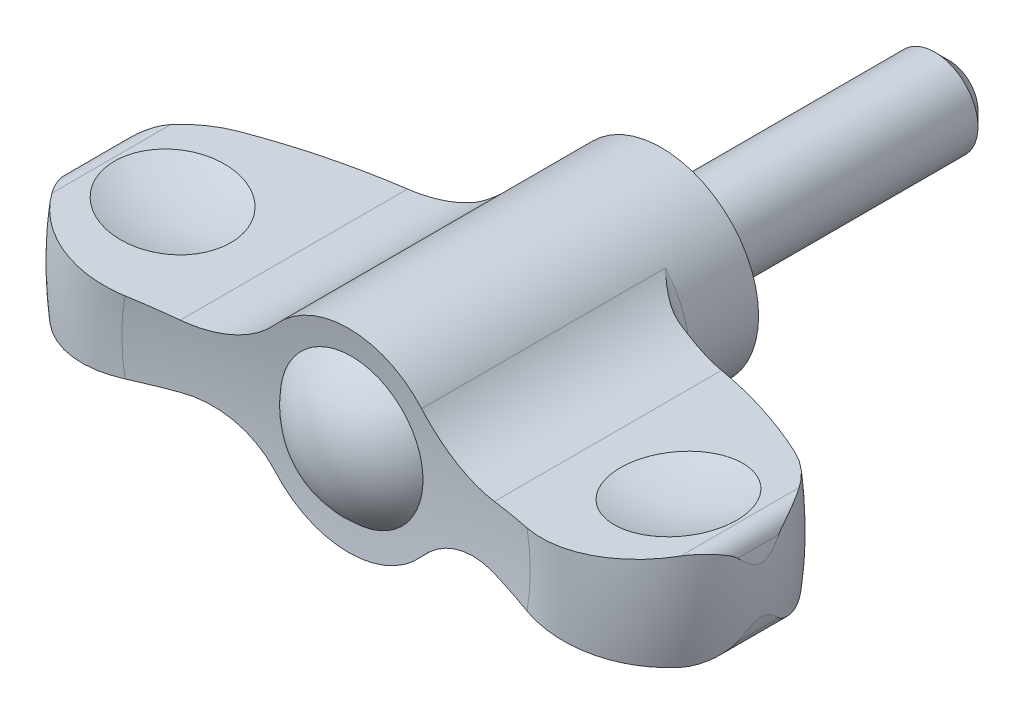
ISO-10303-21;
HEADER;
FILE_DESCRIPTION(('STEP AP214'),'2;1');
FILE_NAME('part.step','',(''),(''),'','','');
FILE_SCHEMA(('AUTOMOTIVE_DESIGN { 1 0 10303 214 1 1 1 1 }'));
ENDSEC;
DATA;
#1=APPLICATION_CONTEXT('core data for automotive mechanical design processes');
#2=APPLICATION_PROTOCOL_DEFINITION('international standard','automotive_design',2000,#1);
#3=PRODUCT_CONTEXT('',#1,'mechanical');
#4=PRODUCT('Part','Part','',(#3));
#5=PRODUCT_RELATED_PRODUCT_CATEGORY('part','',(#4));
#6=PRODUCT_DEFINITION_FORMATION('','',#4);
#7=PRODUCT_DEFINITION_CONTEXT('part definition',#1,'design');
#8=PRODUCT_DEFINITION('design','',#6,#7);
#9=PRODUCT_DEFINITION_SHAPE('','',#8);
#10=(LENGTH_UNIT() NAMED_UNIT(*) SI_UNIT(.MILLI.,.METRE.));
#11=(NAMED_UNIT(*) PLANE_ANGLE_UNIT() SI_UNIT($,.RADIAN.));
#12=(NAMED_UNIT(*) SI_UNIT($,.STERADIAN.) SOLID_ANGLE_UNIT());
#13=UNCERTAINTY_MEASURE_WITH_UNIT(LENGTH_MEASURE(1.E-05),#10,'distance_accuracy_value','');
#14=(GEOMETRIC_REPRESENTATION_CONTEXT(3) GLOBAL_UNCERTAINTY_ASSIGNED_CONTEXT((#13)) GLOBAL_UNIT_ASSIGNED_CONTEXT((#10,
#11,#12)) REPRESENTATION_CONTEXT('',''));
#15=CARTESIAN_POINT('',(0.,0.,0.));
#16=DIRECTION('',(0.,0.,1.));
#17=DIRECTION('',(1.,0.,0.));
#18=AXIS2_PLACEMENT_3D('',#15,#16,#17);
#19=CARTESIAN_POINT('',(0.,0.,72.3));
#20=DIRECTION('',(0.,0.,-1.));
#21=DIRECTION('',(1.,0.,0.));
#22=AXIS2_PLACEMENT_3D('',#19,#20,#21);
#23=SPHERICAL_SURFACE('',#22,51.);
#24=CARTESIAN_POINT('',(0.106101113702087,-0.984705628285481,72.3));
#25=DIRECTION('',(-0.107128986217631,0.994245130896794,0.));
#26=DIRECTION('',(-0.994245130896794,-0.107128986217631,0.));
#27=AXIS2_PLACEMENT_3D('',#24,#25,#26);
#28=CIRCLE('',#27,50.9903824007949);
#29=CARTESIAN_POINT('',(-13.9736878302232,-2.50178976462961,23.3155422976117));
#30=VERTEX_POINT('',#29);
#31=CARTESIAN_POINT('',(-10.91666942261,-2.17239888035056,22.529456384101));
#32=VERTEX_POINT('',#31);
#33=EDGE_CURVE('E30',#30,#32,#28,.F.);
#34=ORIENTED_EDGE('',*,*,#33,.T.);
#35=CARTESIAN_POINT('',(-10.91686942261,-2.17242043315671,22.5295011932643));
#36=CARTESIAN_POINT('',(-10.7296469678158,-2.15222267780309,22.4875506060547));
#37=CARTESIAN_POINT('',(-10.5413017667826,-2.13980901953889,22.4468208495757));
#38=CARTESIAN_POINT('',(-10.1636425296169,-2.13069190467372,22.3680695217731));
#39=CARTESIAN_POINT('',(-9.97432836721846,-2.13399055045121,22.3300483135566));
#40=CARTESIAN_POINT('',(-9.59601268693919,-2.15644826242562,22.2569830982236));
#41=CARTESIAN_POINT('',(-9.40701125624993,-2.17561118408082,22.2219398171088));
#42=CARTESIAN_POINT('',(-9.03072706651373,-2.22980411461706,22.1550981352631));
#43=CARTESIAN_POINT('',(-8.84344419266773,-2.26483305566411,22.1232995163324));
#44=CARTESIAN_POINT('',(-8.47162022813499,-2.35072423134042,22.063129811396));
#45=CARTESIAN_POINT('',(-8.2870846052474,-2.40161451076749,22.034764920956));
#46=CARTESIAN_POINT('',(-7.92248584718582,-2.51896555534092,21.9817487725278));
#47=CARTESIAN_POINT('',(-7.7424225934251,-2.5854259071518,21.9570974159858));
#48=CARTESIAN_POINT('',(-7.38832723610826,-2.7334638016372,21.9117265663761));
#49=CARTESIAN_POINT('',(-7.21428915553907,-2.81502582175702,21.8910030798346));
#50=CARTESIAN_POINT('',(-6.87341920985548,-2.99279306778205,21.8536266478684));
#51=CARTESIAN_POINT('',(-6.70658636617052,-3.08899629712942,21.836973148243));
#52=CARTESIAN_POINT('',(-6.40782206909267,-3.27863643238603,21.8102333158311));
#53=CARTESIAN_POINT('',(-6.27461901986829,-3.36999069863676,21.7995199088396));
#54=CARTESIAN_POINT('',(-6.01493123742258,-3.56204909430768,21.7811068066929));
#55=CARTESIAN_POINT('',(-5.88844563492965,-3.66275200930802,21.7734067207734));
#56=CARTESIAN_POINT('',(-5.64271699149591,-3.87314316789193,21.7610572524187));
#57=CARTESIAN_POINT('',(-5.52348434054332,-3.98284379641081,21.7564121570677));
#58=CARTESIAN_POINT('',(-5.29308424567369,-4.2105332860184,21.7502131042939));
#59=CARTESIAN_POINT('',(-5.18191832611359,-4.32852370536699,21.7486597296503));
#60=CARTESIAN_POINT('',(-5.07512339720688,-4.4503508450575,21.7486647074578));
#61=B_SPLINE_CURVE_WITH_KNOTS('',3,(#35,#36,#37,#38,#39,#40,#41,#42,#43,#44,#45,#46,#47,#48,#49,
#50,#51,#52,#53,#54,#55,#56,#57,#58,#59,#60),.UNSPECIFIED.,.F.,.F.,(4,2,2,2,2,2,2,2,2,2,2,2,4),
(0.,0.578626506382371,1.15733043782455,1.73617505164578,2.31498071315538,2.89481563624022,
3.47463516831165,4.05386199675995,4.63300990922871,5.1182130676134,5.60335328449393,
6.08917285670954,6.57508399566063),.UNSPECIFIED.);
#62=CARTESIAN_POINT('',(-5.07529875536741,-4.4501508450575,21.7486647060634));
#63=VERTEX_POINT('',#62);
#64=EDGE_CURVE('E34',#32,#63,#61,.T.);
#65=ORIENTED_EDGE('',*,*,#64,.T.);
#66=CARTESIAN_POINT('',(0.,0.,21.7486647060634));
#67=DIRECTION('',(0.,0.,1.));
#68=DIRECTION('',(1.,0.,0.));
#69=AXIS2_PLACEMENT_3D('',#66,#67,#68);
#70=CIRCLE('',#69,6.75);
#71=CARTESIAN_POINT('',(5.07529875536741,-4.4501508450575,21.7486647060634));
#72=VERTEX_POINT('',#71);
#73=EDGE_CURVE('E350',#63,#72,#70,.T.);
#74=ORIENTED_EDGE('',*,*,#73,.T.);
#75=CARTESIAN_POINT('',(5.07512339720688,-4.4503508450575,21.7486647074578));
#76=CARTESIAN_POINT('',(5.19811151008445,-4.31003841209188,21.7486568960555));
#77=CARTESIAN_POINT('',(5.32690563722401,-4.1748233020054,21.750718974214));
#78=CARTESIAN_POINT('',(5.59507822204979,-3.91549700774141,21.7589403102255));
#79=CARTESIAN_POINT('',(5.73445549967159,-3.79138458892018,21.7650991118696));
#80=CARTESIAN_POINT('',(6.0224023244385,-3.55546265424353,21.7814490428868));
#81=CARTESIAN_POINT('',(6.17094583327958,-3.44362058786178,21.7916291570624));
#82=CARTESIAN_POINT('',(6.47646460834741,-3.23260452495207,21.8159402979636));
#83=CARTESIAN_POINT('',(6.63343982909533,-3.13343046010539,21.8300713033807));
#84=CARTESIAN_POINT('',(6.9547027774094,-2.94837494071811,21.8621786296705));
#85=CARTESIAN_POINT('',(7.11899194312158,-2.86249611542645,21.8801557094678));
#86=CARTESIAN_POINT('',(7.45373433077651,-2.70454154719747,21.9198257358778));
#87=CARTESIAN_POINT('',(7.62419031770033,-2.63247208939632,21.9415203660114));
#88=CARTESIAN_POINT('',(7.9700647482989,-2.50255377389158,21.9884706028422));
#89=CARTESIAN_POINT('',(8.14548582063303,-2.44471261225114,22.013728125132));
#90=CARTESIAN_POINT('',(8.49988931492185,-2.34360925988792,22.0675996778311));
#91=CARTESIAN_POINT('',(8.67887012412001,-2.30034061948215,22.0962122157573));
#92=CARTESIAN_POINT('',(9.02900148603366,-2.2305564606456,22.1548846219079));
#93=CARTESIAN_POINT('',(9.20002034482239,-2.20322989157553,22.1847703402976));
#94=CARTESIAN_POINT('',(9.54316942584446,-2.1617212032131,22.2471706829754));
#95=CARTESIAN_POINT('',(9.7152996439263,-2.14753903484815,22.2796852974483));
#96=CARTESIAN_POINT('',(10.0596012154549,-2.13229985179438,22.3471369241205));
#97=CARTESIAN_POINT('',(10.2317725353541,-2.13123840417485,22.382073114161));
#98=CARTESIAN_POINT('',(10.5752280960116,-2.14211213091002,22.4541699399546));
#99=CARTESIAN_POINT('',(10.746512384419,-2.154046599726,22.4913304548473));
#100=CARTESIAN_POINT('',(10.91686942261,-2.17242043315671,22.5295011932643));
#101=B_SPLINE_CURVE_WITH_KNOTS('',3,(#75,#76,#77,#78,#79,#80,#81,#82,#83,#84,#85,#86,#87,#88,
#89,#90,#91,#92,#93,#94,#95,#96,#97,#98,#99,#100),.UNSPECIFIED.,.F.,.F.,(4,2,2,2,2,2,2,2,2,2,2,
2,4),(0.,0.559574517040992,1.11908673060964,1.67707683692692,2.2350639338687,2.79316123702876,
3.35151194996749,3.91016401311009,4.46856849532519,4.99529953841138,5.52202861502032,
6.04857972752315,6.57510225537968),.UNSPECIFIED.);
#102=CARTESIAN_POINT('',(10.91666942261,-2.17239888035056,22.529456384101));
#103=VERTEX_POINT('',#102);
#104=EDGE_CURVE('E343',#72,#103,#101,.T.);
#105=ORIENTED_EDGE('',*,*,#104,.T.);
#106=CARTESIAN_POINT('',(-0.10610111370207,-0.984705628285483,72.3));
#107=DIRECTION('',(0.107128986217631,0.994245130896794,0.));
#108=DIRECTION('',(-0.994245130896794,0.107128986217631,0.));
#109=AXIS2_PLACEMENT_3D('',#106,#107,#108);
#110=CIRCLE('',#109,50.9903824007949);
#111=CARTESIAN_POINT('',(13.9736878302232,-2.50178976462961,23.3155422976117));
#112=VERTEX_POINT('',#111);
#113=EDGE_CURVE('E351',#103,#112,#110,.F.);
#114=ORIENTED_EDGE('',*,*,#113,.T.);
#115=CARTESIAN_POINT('',(0.,0.,23.3155422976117));
#116=DIRECTION('',(0.,0.,-1.));
#117=DIRECTION('',(-1.,0.,0.));
#118=AXIS2_PLACEMENT_3D('',#115,#116,#117);
#119=CIRCLE('',#118,14.1958762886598);
#120=CARTESIAN_POINT('',(13.9736878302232,2.50178976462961,23.3155422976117));
#121=VERTEX_POINT('',#120);
#122=EDGE_CURVE('E186',#121,#112,#119,.T.);
#123=ORIENTED_EDGE('',*,*,#122,.F.);
#124=CARTESIAN_POINT('',(-0.10610111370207,0.984705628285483,72.3));
#125=DIRECTION('',(0.107128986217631,-0.994245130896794,0.));
#126=DIRECTION('',(0.994245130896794,0.107128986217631,0.));
#127=AXIS2_PLACEMENT_3D('',#124,#125,#126);
#128=CIRCLE('',#127,50.9903824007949);
#129=CARTESIAN_POINT('',(10.91666942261,2.17239888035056,22.529456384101));
#130=VERTEX_POINT('',#129);
#131=EDGE_CURVE('E370',#121,#130,#128,.F.);
#132=ORIENTED_EDGE('',*,*,#131,.T.);
#133=CARTESIAN_POINT('',(10.91686942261,2.17242043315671,22.5295011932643));
#134=CARTESIAN_POINT('',(10.7296469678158,2.15222267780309,22.4875506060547));
#135=CARTESIAN_POINT('',(10.5413017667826,2.13980901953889,22.4468208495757));
#136=CARTESIAN_POINT('',(10.1636425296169,2.13069190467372,22.3680695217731));
#137=CARTESIAN_POINT('',(9.97432836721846,2.13399055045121,22.3300483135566));
#138=CARTESIAN_POINT('',(9.59601268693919,2.15644826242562,22.2569830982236));
#139=CARTESIAN_POINT('',(9.40701125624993,2.17561118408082,22.2219398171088));
#140=CARTESIAN_POINT('',(9.03072706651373,2.22980411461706,22.1550981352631));
#141=CARTESIAN_POINT('',(8.84344419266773,2.26483305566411,22.1232995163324));
#142=CARTESIAN_POINT('',(8.47162022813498,2.35072423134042,22.063129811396));
#143=CARTESIAN_POINT('',(8.2870846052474,2.40161451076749,22.034764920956));
#144=CARTESIAN_POINT('',(7.92248584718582,2.51896555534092,21.9817487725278));
#145=CARTESIAN_POINT('',(7.7424225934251,2.5854259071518,21.9570974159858));
#146=CARTESIAN_POINT('',(7.38832723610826,2.7334638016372,21.9117265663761));
#147=CARTESIAN_POINT('',(7.21428915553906,2.81502582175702,21.8910030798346));
#148=CARTESIAN_POINT('',(6.87341920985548,2.99279306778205,21.8536266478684));
#149=CARTESIAN_POINT('',(6.70658636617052,3.08899629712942,21.836973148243));
#150=CARTESIAN_POINT('',(6.40782206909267,3.27863643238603,21.8102333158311));
#151=CARTESIAN_POINT('',(6.27461901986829,3.36999069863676,21.7995199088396));
#152=CARTESIAN_POINT('',(6.01493123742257,3.56204909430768,21.7811068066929));
#153=CARTESIAN_POINT('',(5.88844563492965,3.66275200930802,21.7734067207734));
#154=CARTESIAN_POINT('',(5.64271699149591,3.87314316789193,21.7610572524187));
#155=CARTESIAN_POINT('',(5.52348434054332,3.98284379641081,21.7564121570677));
#156=CARTESIAN_POINT('',(5.29308424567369,4.2105332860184,21.7502131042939));
#157=CARTESIAN_POINT('',(5.18191832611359,4.32852370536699,21.7486597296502));
#158=CARTESIAN_POINT('',(5.07512339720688,4.4503508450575,21.7486647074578));
#159=B_SPLINE_CURVE_WITH_KNOTS('',3,(#133,#134,#135,#136,#137,#138,#139,#140,#141,#142,#143,
#144,#145,#146,#147,#148,#149,#150,#151,#152,#153,#154,#155,#156,#157,#158),.UNSPECIFIED.,.F.,
.F.,(4,2,2,2,2,2,2,2,2,2,2,2,4),(0.,0.578626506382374,1.15733043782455,1.73617505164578,
2.31498071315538,2.89481563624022,3.47463516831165,4.05386199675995,4.63300990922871,
5.1182130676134,5.60335328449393,6.08917285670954,6.57508399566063),.UNSPECIFIED.);
#160=CARTESIAN_POINT('',(5.07529875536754,4.45015084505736,21.7486647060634));
#161=VERTEX_POINT('',#160);
#162=EDGE_CURVE('E320',#130,#161,#159,.T.);
#163=ORIENTED_EDGE('',*,*,#162,.T.);
#164=CARTESIAN_POINT('',(0.,0.,21.7486647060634));
#165=DIRECTION('',(0.,0.,1.));
#166=DIRECTION('',(1.,0.,0.));
#167=AXIS2_PLACEMENT_3D('',#164,#165,#166);
#168=CIRCLE('',#167,6.75);
#169=CARTESIAN_POINT('',(-5.07529875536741,4.4501508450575,21.7486647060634));
#170=VERTEX_POINT('',#169);
#171=EDGE_CURVE('E326',#161,#170,#168,.T.);
#172=ORIENTED_EDGE('',*,*,#171,.T.);
#173=CARTESIAN_POINT('',(-5.07512339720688,4.4503508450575,21.7486647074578));
#174=CARTESIAN_POINT('',(-5.19811151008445,4.31003841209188,21.7486568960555));
#175=CARTESIAN_POINT('',(-5.32690563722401,4.1748233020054,21.750718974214));
#176=CARTESIAN_POINT('',(-5.59507822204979,3.91549700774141,21.7589403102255));
#177=CARTESIAN_POINT('',(-5.73445549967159,3.79138458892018,21.7650991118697));
#178=CARTESIAN_POINT('',(-6.0224023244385,3.55546265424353,21.7814490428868));
#179=CARTESIAN_POINT('',(-6.17094583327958,3.44362058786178,21.7916291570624));
#180=CARTESIAN_POINT('',(-6.47646460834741,3.23260452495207,21.8159402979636));
#181=CARTESIAN_POINT('',(-6.63343982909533,3.13343046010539,21.8300713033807));
#182=CARTESIAN_POINT('',(-6.9547027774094,2.94837494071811,21.8621786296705));
#183=CARTESIAN_POINT('',(-7.11899194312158,2.86249611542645,21.8801557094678));
#184=CARTESIAN_POINT('',(-7.45373433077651,2.70454154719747,21.9198257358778));
#185=CARTESIAN_POINT('',(-7.62419031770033,2.63247208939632,21.9415203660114));
#186=CARTESIAN_POINT('',(-7.9700647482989,2.50255377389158,21.9884706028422));
#187=CARTESIAN_POINT('',(-8.14548582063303,2.44471261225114,22.013728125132));
#188=CARTESIAN_POINT('',(-8.49988931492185,2.34360925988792,22.0675996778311));
#189=CARTESIAN_POINT('',(-8.67887012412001,2.30034061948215,22.0962122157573));
#190=CARTESIAN_POINT('',(-9.02900148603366,2.2305564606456,22.1548846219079));
#191=CARTESIAN_POINT('',(-9.20002034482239,2.20322989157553,22.1847703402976));
#192=CARTESIAN_POINT('',(-9.54316942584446,2.1617212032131,22.2471706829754));
#193=CARTESIAN_POINT('',(-9.7152996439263,2.14753903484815,22.2796852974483));
#194=CARTESIAN_POINT('',(-10.0596012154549,2.13229985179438,22.3471369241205));
#195=CARTESIAN_POINT('',(-10.2317725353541,2.13123840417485,22.382073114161));
#196=CARTESIAN_POINT('',(-10.5752280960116,2.14211213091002,22.4541699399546));
#197=CARTESIAN_POINT('',(-10.746512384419,2.154046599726,22.4913304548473));
#198=CARTESIAN_POINT('',(-10.91686942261,2.17242043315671,22.5295011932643));
#199=B_SPLINE_CURVE_WITH_KNOTS('',3,(#173,#174,#175,#176,#177,#178,#179,#180,#181,#182,#183,
#184,#185,#186,#187,#188,#189,#190,#191,#192,#193,#194,#195,#196,#197,#198),.UNSPECIFIED.,.F.,
.F.,(4,2,2,2,2,2,2,2,2,2,2,2,4),(0.,0.559574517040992,1.11908673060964,1.67707683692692,
2.2350639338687,2.79316123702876,3.35151194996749,3.91016401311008,4.46856849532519,
4.99529953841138,5.52202861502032,6.04857972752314,6.57510225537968),.UNSPECIFIED.);
#200=CARTESIAN_POINT('',(-10.91666942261,2.17239888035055,22.529456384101));
#201=VERTEX_POINT('',#200);
#202=EDGE_CURVE('E191',#170,#201,#199,.T.);
#203=ORIENTED_EDGE('',*,*,#202,.T.);
#204=CARTESIAN_POINT('',(0.106101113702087,0.984705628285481,72.3));
#205=DIRECTION('',(-0.107128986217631,-0.994245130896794,0.));
#206=DIRECTION('',(0.994245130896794,-0.107128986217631,0.));
#207=AXIS2_PLACEMENT_3D('',#204,#205,#206);
#208=CIRCLE('',#207,50.9903824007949);
#209=CARTESIAN_POINT('',(-13.9736878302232,2.50178976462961,23.3155422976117));
#210=VERTEX_POINT('',#209);
#211=EDGE_CURVE('E446',#201,#210,#208,.F.);
#212=ORIENTED_EDGE('',*,*,#211,.T.);
#213=EDGE_CURVE('E495',#30,#210,#119,.T.);
#214=ORIENTED_EDGE('',*,*,#213,.F.);
#215=EDGE_LOOP('',(#34,#65,#74,#105,#114,#123,#132,#163,#172,#203,#212,#214));
#216=FACE_BOUND('',#215,.T.);
#217=CARTESIAN_POINT('',(0.,0.,21.5419708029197));
#218=DIRECTION('',(0.,0.,-1.));
#219=DIRECTION('',(-1.,0.,0.));
#220=AXIS2_PLACEMENT_3D('',#217,#218,#219);
#221=CIRCLE('',#220,4.96210358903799);
#222=CARTESIAN_POINT('',(-4.96210358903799,0.,21.5419708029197));
#223=VERTEX_POINT('',#222);
#224=EDGE_CURVE('E383',#223,#223,#221,.T.);
#225=ORIENTED_EDGE('',*,*,#224,.T.);
#226=EDGE_LOOP('',(#225));
#227=FACE_BOUND('',#226,.T.);
#228=ADVANCED_FACE('F14',(#216,#227),#23,.F.);
#229=CARTESIAN_POINT('',(-10.91666942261,-2.17239888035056,24.));
#230=DIRECTION('',(-0.107128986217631,0.994245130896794,0.));
#231=DIRECTION('',(-0.994245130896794,-0.107128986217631,0.));
#232=AXIS2_PLACEMENT_3D('',#229,#230,#231);
#233=PLANE('',#232);
#234=ORIENTED_EDGE('',*,*,#33,.F.);
#235=CARTESIAN_POINT('',(-21.8457309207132,-3.34999507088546,20.5252646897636));
#236=CARTESIAN_POINT('',(-21.7302435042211,-3.33755140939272,20.6912978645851));
#237=CARTESIAN_POINT('',(-21.6077536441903,-3.32435324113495,20.8523984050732));
#238=CARTESIAN_POINT('',(-21.3497248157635,-3.29655087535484,21.1636425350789));
#239=CARTESIAN_POINT('',(-21.2141865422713,-3.28194675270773,21.3137867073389));
#240=CARTESIAN_POINT('',(-20.9311105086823,-3.25144557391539,21.6019360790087));
#241=CARTESIAN_POINT('',(-20.783581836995,-3.23554949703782,21.7399503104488));
#242=CARTESIAN_POINT('',(-20.4774952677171,-3.20256895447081,22.0029918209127));
#243=CARTESIAN_POINT('',(-20.3189374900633,-3.18548450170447,22.1280192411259));
#244=CARTESIAN_POINT('',(-19.9918782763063,-3.15024417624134,22.3642331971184));
#245=CARTESIAN_POINT('',(-19.8233743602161,-3.13208803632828,22.4754162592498));
#246=CARTESIAN_POINT('',(-19.4775952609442,-3.09483066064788,22.6831586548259));
#247=CARTESIAN_POINT('',(-19.3003168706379,-3.07572907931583,22.7797125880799));
#248=CARTESIAN_POINT('',(-18.9383738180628,-3.0367300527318,22.9574348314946));
#249=CARTESIAN_POINT('',(-18.7537118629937,-3.01683289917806,23.0386087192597));
#250=CARTESIAN_POINT('',(-18.3782492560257,-2.97637715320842,23.1850463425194));
#251=CARTESIAN_POINT('',(-18.1874484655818,-2.95581854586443,23.2503097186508));
#252=CARTESIAN_POINT('',(-17.8008818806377,-2.91416635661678,23.3645224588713));
#253=CARTESIAN_POINT('',(-17.6051115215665,-2.89307228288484,23.4134561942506));
#254=CARTESIAN_POINT('',(-17.2101714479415,-2.85051785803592,23.4945837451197));
#255=CARTESIAN_POINT('',(-17.011001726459,-2.82905750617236,23.5267775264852));
#256=CARTESIAN_POINT('',(-16.6106619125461,-2.78592126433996,23.5742057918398));
#257=CARTESIAN_POINT('',(-16.4094916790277,-2.76424535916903,23.589439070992));
#258=CARTESIAN_POINT('',(-16.006594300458,-2.72083354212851,23.6028415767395));
#259=CARTESIAN_POINT('',(-15.804867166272,-2.69909763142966,23.6010111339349));
#260=CARTESIAN_POINT('',(-15.4019677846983,-2.65568559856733,23.5802910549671));
#261=CARTESIAN_POINT('',(-15.2007968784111,-2.63400962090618,23.5613750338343));
#262=CARTESIAN_POINT('',(-14.8008192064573,-2.59091239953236,23.5065973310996));
#263=CARTESIAN_POINT('',(-14.6020116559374,-2.56949107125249,23.47074144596));
#264=CARTESIAN_POINT('',(-14.2079744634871,-2.52703393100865,23.3823184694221));
#265=CARTESIAN_POINT('',(-14.0127471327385,-2.50599836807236,23.3297409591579));
#266=CARTESIAN_POINT('',(-13.6273876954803,-2.46447624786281,23.208260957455));
#267=CARTESIAN_POINT('',(-13.4372553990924,-2.44398967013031,23.1393590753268));
#268=CARTESIAN_POINT('',(-13.0629639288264,-2.40366011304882,22.985531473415));
#269=CARTESIAN_POINT('',(-12.8788206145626,-2.38381884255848,22.9005667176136));
#270=CARTESIAN_POINT('',(-12.5183119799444,-2.34497437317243,22.7153302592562));
#271=CARTESIAN_POINT('',(-12.3419464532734,-2.3259711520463,22.6150589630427));
#272=CARTESIAN_POINT('',(-11.9985630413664,-2.28897190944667,22.400122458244));
#273=CARTESIAN_POINT('',(-11.8315288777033,-2.27097413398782,22.2854835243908));
#274=CARTESIAN_POINT('',(-11.5077189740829,-2.23608391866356,22.0425218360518));
#275=CARTESIAN_POINT('',(-11.3509370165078,-2.21919080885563,21.9142075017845));
#276=CARTESIAN_POINT('',(-11.1514082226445,-2.19769176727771,21.7363546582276));
#277=CARTESIAN_POINT('',(-11.1035524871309,-2.19253535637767,21.6925222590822));
#278=CARTESIAN_POINT('',(-11.0090859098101,-2.18235667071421,21.6036210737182));
#279=CARTESIAN_POINT('',(-10.9624737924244,-2.17733425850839,21.5585536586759));
#280=CARTESIAN_POINT('',(-10.91646942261,-2.17237733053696,21.5128574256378));
#281=B_SPLINE_CURVE_WITH_KNOTS('',3,(#235,#236,#237,#238,#239,#240,#241,#242,#243,#244,#245,
#246,#247,#248,#249,#250,#251,#252,#253,#254,#255,#256,#257,#258,#259,#260,#261,#262,#263,#264,
#265,#266,#267,#268,#269,#270,#271,#272,#273,#274,#275,#276,#277,#278,#279,#280),.UNSPECIFIED.,
.F.,.F.,(4,2,2,2,2,2,2,2,2,2,2,2,2,2,2,2,2,2,2,2,2,2,4),(0.,0.607705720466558,1.21537909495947,
1.82259608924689,2.42980648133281,3.03716892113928,3.64475501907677,4.25212035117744,
4.85949940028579,5.46745810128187,6.07541804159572,6.68342116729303,7.29141251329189,
7.90034437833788,8.50906803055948,9.11817171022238,9.72725265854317,10.3378332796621,
10.9483976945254,11.557861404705,12.166952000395,12.3622359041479,12.5573111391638),.UNSPECIFIED.);
#282=CARTESIAN_POINT('',(-21.8455309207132,-3.34997352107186,20.5255521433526));
#283=VERTEX_POINT('',#282);
#284=EDGE_CURVE('E904',#283,#30,#281,.T.);
#285=ORIENTED_EDGE('',*,*,#284,.F.);
#286=DIRECTION('',(0.,0.,-1.));
#287=VECTOR('',#286,1.);
#288=CARTESIAN_POINT('',(-21.8455309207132,-3.34997352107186,24.));
#289=LINE('',#288,#287);
#290=CARTESIAN_POINT('',(-21.8455309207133,-3.34997352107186,12.2746267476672));
#291=VERTEX_POINT('',#290);
#292=EDGE_CURVE('E465',#283,#291,#289,.T.);
#293=ORIENTED_EDGE('',*,*,#292,.T.);
#294=CARTESIAN_POINT('',(-19.2945778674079,-3.07511070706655,10.0206583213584));
#295=CARTESIAN_POINT('',(-19.4747975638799,-3.09452921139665,10.1153575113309));
#296=CARTESIAN_POINT('',(-19.6509896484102,-3.11351374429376,10.2178086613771));
#297=CARTESIAN_POINT('',(-19.9941575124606,-3.15048976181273,10.4374340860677));
#298=CARTESIAN_POINT('',(-20.1611295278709,-3.16848084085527,10.55461431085));
#299=CARTESIAN_POINT('',(-20.4813600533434,-3.20298538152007,10.8003921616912));
#300=CARTESIAN_POINT('',(-20.6348240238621,-3.21952098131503,10.9287191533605));
#301=CARTESIAN_POINT('',(-20.9305024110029,-3.25138005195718,11.1977390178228));
#302=CARTESIAN_POINT('',(-21.0727226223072,-3.26670414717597,11.3384254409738));
#303=CARTESIAN_POINT('',(-21.3235946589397,-3.29373537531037,11.608219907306));
#304=CARTESIAN_POINT('',(-21.43401009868,-3.3056325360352,11.7356749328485));
#305=CARTESIAN_POINT('',(-21.6465578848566,-3.32853436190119,11.9991858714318));
#306=CARTESIAN_POINT('',(-21.7486121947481,-3.33953061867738,12.135305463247));
#307=CARTESIAN_POINT('',(-21.8457309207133,-3.34999507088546,12.2749142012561));
#308=B_SPLINE_CURVE_WITH_KNOTS('',3,(#294,#295,#296,#297,#298,#299,#300,#301,#302,#303,#304,
#305,#306,#307),.UNSPECIFIED.,.F.,.F.,(4,2,2,2,2,2,4),(0.,0.613344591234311,1.22693775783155,
1.82843414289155,2.42961848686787,2.93636077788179,3.44739305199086),.UNSPECIFIED.);
#309=CARTESIAN_POINT('',(-19.2949583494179,-3.07515170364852,10.0208583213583));
#310=VERTEX_POINT('',#309);
#311=EDGE_CURVE('E877',#310,#291,#308,.T.);
#312=ORIENTED_EDGE('',*,*,#311,.F.);
#313=CARTESIAN_POINT('',(-10.91646942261,-2.17237733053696,6.74022888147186));
#314=CARTESIAN_POINT('',(-11.6429801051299,-2.2506581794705,6.93529272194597));
#315=CARTESIAN_POINT('',(-12.3641189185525,-2.32836021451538,7.15058575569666));
#316=CARTESIAN_POINT('',(-13.791310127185,-2.48213873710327,7.62017172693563));
#317=CARTESIAN_POINT('',(-14.4974016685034,-2.558219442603,7.87434431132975));
#318=CARTESIAN_POINT('',(-15.8945921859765,-2.70876541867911,8.42142446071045));
#319=CARTESIAN_POINT('',(-16.5856911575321,-2.78323068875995,8.71433203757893));
#320=CARTESIAN_POINT('',(-17.9528888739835,-2.93054496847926,9.33891493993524));
#321=CARTESIAN_POINT('',(-18.6289355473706,-3.0033883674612,9.67070557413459));
#322=CARTESIAN_POINT('',(-19.2953387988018,-3.07519269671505,10.0210583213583));
#323=B_SPLINE_CURVE_WITH_KNOTS('',3,(#313,#314,#315,#316,#317,#318,#319,#320,#321,#322),
.UNSPECIFIED.,.F.,.F.,(4,2,2,2,4),(0.,2.26861905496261,4.53035255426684,6.79208674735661,
9.06070650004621),.UNSPECIFIED.);
#324=CARTESIAN_POINT('',(-10.91666942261,-2.17239888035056,6.74028258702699));
#325=VERTEX_POINT('',#324);
#326=EDGE_CURVE('E268',#325,#310,#323,.T.);
#327=ORIENTED_EDGE('',*,*,#326,.F.);
#328=DIRECTION('',(0.,0.,-1.));
#329=VECTOR('',#328,1.);
#330=CARTESIAN_POINT('',(-10.91666942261,-2.17239888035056,24.));
#331=LINE('',#330,#329);
#332=EDGE_CURVE('E462',#32,#325,#331,.T.);
#333=ORIENTED_EDGE('',*,*,#332,.F.);
#334=EDGE_LOOP('',(#234,#285,#293,#312,#327,#333));
#335=FACE_BOUND('',#334,.T.);
#336=CARTESIAN_POINT('',(-17.5815922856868,-2.89053810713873,16.4));
#337=DIRECTION('',(-0.107128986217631,0.994245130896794,0.));
#338=DIRECTION('',(-0.994245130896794,-0.107128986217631,0.));
#339=AXIS2_PLACEMENT_3D('',#336,#337,#338);
#340=CIRCLE('',#339,4.06502356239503);
#341=CARTESIAN_POINT('',(-21.6232221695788,-3.3260199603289,16.4));
#342=VERTEX_POINT('',#341);
#343=EDGE_CURVE('E380',#342,#342,#340,.F.);
#344=ORIENTED_EDGE('',*,*,#343,.F.);
#345=EDGE_LOOP('',(#344));
#346=FACE_BOUND('',#345,.T.);
#347=ADVANCED_FACE('F292',(#335,#346),#233,.F.);
#348=CARTESIAN_POINT('',(-10.91666942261,2.17239888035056,24.));
#349=DIRECTION('',(-0.107128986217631,-0.994245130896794,0.));
#350=DIRECTION('',(0.994245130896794,-0.107128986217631,0.));
#351=AXIS2_PLACEMENT_3D('',#348,#349,#350);
#352=PLANE('',#351);
#353=ORIENTED_EDGE('',*,*,#211,.F.);
#354=DIRECTION('',(0.,0.,-1.));
#355=VECTOR('',#354,1.);
#356=CARTESIAN_POINT('',(-10.91666942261,2.17239888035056,24.));
#357=LINE('',#356,#355);
#358=CARTESIAN_POINT('',(-10.91666942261,2.17239888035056,6.74028258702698));
#359=VERTEX_POINT('',#358);
#360=EDGE_CURVE('E193',#201,#359,#357,.T.);
#361=ORIENTED_EDGE('',*,*,#360,.T.);
#362=CARTESIAN_POINT('',(-19.2953387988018,3.07519269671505,10.0210583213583));
#363=CARTESIAN_POINT('',(-18.6289355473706,3.0033883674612,9.67070557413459));
#364=CARTESIAN_POINT('',(-17.9528888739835,2.93054496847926,9.33891493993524));
#365=CARTESIAN_POINT('',(-16.5856911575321,2.78323068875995,8.71433203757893));
#366=CARTESIAN_POINT('',(-15.8945921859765,2.70876541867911,8.42142446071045));
#367=CARTESIAN_POINT('',(-14.4974016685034,2.558219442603,7.87434431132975));
#368=CARTESIAN_POINT('',(-13.791310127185,2.48213873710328,7.62017172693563));
#369=CARTESIAN_POINT('',(-12.3641189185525,2.32836021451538,7.15058575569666));
#370=CARTESIAN_POINT('',(-11.6429801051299,2.2506581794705,6.93529272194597));
#371=CARTESIAN_POINT('',(-10.91646942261,2.17237733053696,6.74022888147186));
#372=B_SPLINE_CURVE_WITH_KNOTS('',3,(#362,#363,#364,#365,#366,#367,#368,#369,#370,#371),
.UNSPECIFIED.,.F.,.F.,(4,2,2,2,4),(0.,2.2686197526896,4.53035394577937,6.7920874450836,
9.06070650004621),.UNSPECIFIED.);
#373=CARTESIAN_POINT('',(-19.2949583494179,3.07515170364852,10.0208583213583));
#374=VERTEX_POINT('',#373);
#375=EDGE_CURVE('E275',#374,#359,#372,.T.);
#376=ORIENTED_EDGE('',*,*,#375,.F.);
#377=CARTESIAN_POINT('',(-16.1316021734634,2.73430302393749,9.20190527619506));
#378=CARTESIAN_POINT('',(-16.3336188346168,2.75607013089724,9.20643915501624));
#379=CARTESIAN_POINT('',(-16.5354410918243,2.777816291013,9.2195877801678));
#380=CARTESIAN_POINT('',(-16.9372607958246,2.82111198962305,9.2629315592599));
#381=CARTESIAN_POINT('',(-17.1372583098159,2.84266153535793,9.29312608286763));
#382=CARTESIAN_POINT('',(-17.53371131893,2.88537897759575,9.37032135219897));
#383=CARTESIAN_POINT('',(-17.7301716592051,2.90654739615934,9.41729692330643));
#384=CARTESIAN_POINT('',(-18.1184556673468,2.94838463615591,9.52772695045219));
#385=CARTESIAN_POINT('',(-18.310279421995,2.9690534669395,9.59118109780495));
#386=CARTESIAN_POINT('',(-18.6875910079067,3.00970843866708,9.73399849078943));
#387=CARTESIAN_POINT('',(-18.8730894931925,3.02969572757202,9.81333326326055));
#388=CARTESIAN_POINT('',(-19.236871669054,3.0688929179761,9.98746420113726));
#389=CARTESIAN_POINT('',(-19.4151520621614,3.08810246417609,10.0822673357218));
#390=CARTESIAN_POINT('',(-19.7631321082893,3.12559698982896,10.2866372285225));
#391=CARTESIAN_POINT('',(-19.9328321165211,3.14388200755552,10.3962033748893));
#392=CARTESIAN_POINT('',(-20.2623750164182,3.17938994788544,10.6292750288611));
#393=CARTESIAN_POINT('',(-20.4222223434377,3.19661334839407,10.7527741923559));
#394=CARTESIAN_POINT('',(-20.7309200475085,3.22987523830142,11.0128081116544));
#395=CARTESIAN_POINT('',(-20.8797763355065,3.24591436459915,11.1493357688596));
#396=CARTESIAN_POINT('',(-21.1655301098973,3.27670406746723,11.4345171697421));
#397=CARTESIAN_POINT('',(-21.3024274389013,3.29145462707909,11.58317107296));
#398=CARTESIAN_POINT('',(-21.5634920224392,3.3195840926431,11.8918051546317));
#399=CARTESIAN_POINT('',(-21.6876381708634,3.33296072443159,12.0518033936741));
#400=CARTESIAN_POINT('',(-21.9220837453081,3.35822201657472,12.3817648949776));
#401=CARTESIAN_POINT('',(-22.0323824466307,3.37010659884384,12.5517286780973));
#402=CARTESIAN_POINT('',(-22.1353199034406,3.3811980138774,12.7260937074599));
#403=B_SPLINE_CURVE_WITH_KNOTS('',3,(#377,#378,#379,#380,#381,#382,#383,#384,#385,#386,#387,
#388,#389,#390,#391,#392,#393,#394,#395,#396,#397,#398,#399,#400,#401,#402),.UNSPECIFIED.,.F.,
.F.,(4,2,2,2,2,2,2,2,2,2,2,2,4),(0.,0.60952472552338,1.21902691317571,1.82761855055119,
2.43619878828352,3.04369749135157,3.65147065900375,4.25921864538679,4.86669101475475,
5.47383427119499,6.080985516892,6.68912606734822,7.29729843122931),.UNSPECIFIED.);
#404=CARTESIAN_POINT('',(-21.845530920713,3.34997352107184,12.2746267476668));
#405=VERTEX_POINT('',#404);
#406=EDGE_CURVE('E302',#405,#374,#403,.F.);
#407=ORIENTED_EDGE('',*,*,#406,.F.);
#408=DIRECTION('',(0.,0.,-1.));
#409=VECTOR('',#408,1.);
#410=CARTESIAN_POINT('',(-21.8455309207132,3.34997352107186,24.));
#411=LINE('',#410,#409);
#412=CARTESIAN_POINT('',(-21.8455309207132,3.34997352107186,20.5255521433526));
#413=VERTEX_POINT('',#412);
#414=EDGE_CURVE('E198',#413,#405,#411,.T.);
#415=ORIENTED_EDGE('',*,*,#414,.F.);
#416=CARTESIAN_POINT('',(-10.91646942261,2.17237733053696,21.5128574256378));
#417=CARTESIAN_POINT('',(-11.060414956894,2.18788732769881,21.6558705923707));
#418=CARTESIAN_POINT('',(-11.2103909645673,2.20404710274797,21.7927365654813));
#419=CARTESIAN_POINT('',(-11.5212615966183,2.23754312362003,22.0532734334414));
#420=CARTESIAN_POINT('',(-11.682155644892,2.25487930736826,22.1769450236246));
#421=CARTESIAN_POINT('',(-12.013622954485,2.29059460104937,22.4101285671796));
#422=CARTESIAN_POINT('',(-12.1841895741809,2.3089729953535,22.5196500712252));
#423=CARTESIAN_POINT('',(-12.5338820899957,2.3466520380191,22.723861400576));
#424=CARTESIAN_POINT('',(-12.7130078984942,2.36595267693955,22.8185513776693));
#425=CARTESIAN_POINT('',(-13.0785959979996,2.40534445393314,22.9924500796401));
#426=CARTESIAN_POINT('',(-13.2650601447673,2.42543579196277,23.0716548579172));
#427=CARTESIAN_POINT('',(-13.6440277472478,2.46626919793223,23.2140153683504));
#428=CARTESIAN_POINT('',(-13.8365334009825,2.48701150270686,23.2771651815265));
#429=CARTESIAN_POINT('',(-14.2260776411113,2.5289845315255,23.3869042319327));
#430=CARTESIAN_POINT('',(-14.4231144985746,2.55021506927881,23.433499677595));
#431=CARTESIAN_POINT('',(-14.8203952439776,2.59302169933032,23.5098273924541));
#432=CARTESIAN_POINT('',(-15.0206391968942,2.6145977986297,23.5395593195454));
#433=CARTESIAN_POINT('',(-15.4229162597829,2.65794277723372,23.581941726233));
#434=CARTESIAN_POINT('',(-15.6249494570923,2.67971166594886,23.5945913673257));
#435=CARTESIAN_POINT('',(-16.0293573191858,2.72328623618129,23.6027094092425));
#436=CARTESIAN_POINT('',(-16.2317319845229,2.74509191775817,23.5981777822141));
#437=CARTESIAN_POINT('',(-16.6353922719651,2.78858593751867,23.5719573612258));
#438=CARTESIAN_POINT('',(-16.8366778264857,2.81027426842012,23.5502675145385));
#439=CARTESIAN_POINT('',(-17.2367059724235,2.85337692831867,23.4898773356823));
#440=CARTESIAN_POINT('',(-17.4354486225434,2.87479126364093,23.451177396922));
#441=CARTESIAN_POINT('',(-17.8286809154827,2.91716167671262,23.3571066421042));
#442=CARTESIAN_POINT('',(-18.0231764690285,2.93811839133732,23.3017608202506));
#443=CARTESIAN_POINT('',(-18.4067663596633,2.97944984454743,23.1747874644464));
#444=CARTESIAN_POINT('',(-18.5958625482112,2.99982478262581,23.1031655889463));
#445=CARTESIAN_POINT('',(-18.9674894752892,3.03986723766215,22.9440840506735));
#446=CARTESIAN_POINT('',(-19.1500160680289,3.05953430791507,22.8566145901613));
#447=CARTESIAN_POINT('',(-19.5070671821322,3.09800623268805,22.6664899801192));
#448=CARTESIAN_POINT('',(-19.6815920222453,3.11681112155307,22.5638354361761));
#449=CARTESIAN_POINT('',(-20.0212685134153,3.15341094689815,22.3441502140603));
#450=CARTESIAN_POINT('',(-20.1864271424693,3.17120663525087,22.2271304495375));
#451=CARTESIAN_POINT('',(-20.5063289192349,3.20567575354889,21.9794851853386));
#452=CARTESIAN_POINT('',(-20.6610723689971,3.22234921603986,21.8488600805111));
#453=CARTESIAN_POINT('',(-20.9587578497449,3.25442454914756,21.5751939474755));
#454=CARTESIAN_POINT('',(-21.1017211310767,3.26982870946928,21.4321762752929));
#455=CARTESIAN_POINT('',(-21.3750859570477,3.29928351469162,21.1345878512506));
#456=CARTESIAN_POINT('',(-21.5054952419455,3.31333499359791,20.9800243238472));
#457=CARTESIAN_POINT('',(-21.6665115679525,3.33068435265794,20.7720063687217));
#458=CARTESIAN_POINT('',(-21.7032508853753,3.3346429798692,20.7232730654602));
#459=CARTESIAN_POINT('',(-21.7754460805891,3.34242194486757,20.6249310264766));
#460=CARTESIAN_POINT('',(-21.8109032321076,3.34624241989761,20.5753232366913));
#461=CARTESIAN_POINT('',(-21.8457309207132,3.34999507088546,20.5252646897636));
#462=B_SPLINE_CURVE_WITH_KNOTS('',3,(#416,#417,#418,#419,#420,#421,#422,#423,#424,#425,#426,
#427,#428,#429,#430,#431,#432,#433,#434,#435,#436,#437,#438,#439,#440,#441,#442,#443,#444,#445,
#446,#447,#448,#449,#450,#451,#452,#453,#454,#455,#456,#457,#458,#459,#460,#461),.UNSPECIFIED.,
.F.,.F.,(4,2,2,2,2,2,2,2,2,2,2,2,2,2,2,2,2,2,2,2,2,2,4),(0.,0.610322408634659,1.22061263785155,
1.83048877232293,2.44035866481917,3.05038378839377,3.66063348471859,4.27065407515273,
4.88068704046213,5.49074994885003,6.10081384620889,6.71091517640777,7.32100239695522,
7.93017809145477,8.5391423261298,9.14848434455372,9.75780206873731,10.3666597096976,
10.9754996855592,11.5832161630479,12.1905555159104,12.3740180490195,12.5572930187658),.UNSPECIFIED.);
#463=EDGE_CURVE('E308',#210,#413,#462,.T.);
#464=ORIENTED_EDGE('',*,*,#463,.F.);
#465=EDGE_LOOP('',(#353,#361,#376,#407,#415,#464));
#466=FACE_BOUND('',#465,.T.);
#467=CARTESIAN_POINT('',(-17.5815922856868,2.89053810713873,16.4));
#468=DIRECTION('',(-0.107128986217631,-0.994245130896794,0.));
#469=DIRECTION('',(0.994245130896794,-0.107128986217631,0.));
#470=AXIS2_PLACEMENT_3D('',#467,#468,#469);
#471=CIRCLE('',#470,4.06502356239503);
#472=CARTESIAN_POINT('',(-13.5399624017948,2.45505625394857,16.4));
#473=VERTEX_POINT('',#472);
#474=EDGE_CURVE('E377',#473,#473,#471,.F.);
#475=ORIENTED_EDGE('',*,*,#474,.F.);
#476=EDGE_LOOP('',(#475));
#477=FACE_BOUND('',#476,.T.);
#478=ADVANCED_FACE('F287',(#466,#477),#352,.F.);
#479=CARTESIAN_POINT('',(10.91666942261,-2.17239888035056,24.));
#480=DIRECTION('',(0.107128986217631,0.994245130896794,0.));
#481=DIRECTION('',(-0.994245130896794,0.107128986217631,0.));
#482=AXIS2_PLACEMENT_3D('',#479,#480,#481);
#483=PLANE('',#482);
#484=ORIENTED_EDGE('',*,*,#113,.F.);
#485=DIRECTION('',(0.,0.,-1.));
#486=VECTOR('',#485,1.);
#487=CARTESIAN_POINT('',(10.91666942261,-2.17239888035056,24.));
#488=LINE('',#487,#486);
#489=CARTESIAN_POINT('',(10.91666942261,-2.17239888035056,6.74028258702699));
#490=VERTEX_POINT('',#489);
#491=EDGE_CURVE('E441',#103,#490,#488,.T.);
#492=ORIENTED_EDGE('',*,*,#491,.T.);
#493=CARTESIAN_POINT('',(19.2953387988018,-3.07519269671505,10.0210583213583));
#494=CARTESIAN_POINT('',(18.6289355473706,-3.0033883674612,9.67070557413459));
#495=CARTESIAN_POINT('',(17.9528888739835,-2.93054496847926,9.33891493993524));
#496=CARTESIAN_POINT('',(16.5856911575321,-2.78323068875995,8.71433203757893));
#497=CARTESIAN_POINT('',(15.8945921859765,-2.70876541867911,8.42142446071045));
#498=CARTESIAN_POINT('',(14.4974016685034,-2.558219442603,7.87434431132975));
#499=CARTESIAN_POINT('',(13.791310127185,-2.48213873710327,7.62017172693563));
#500=CARTESIAN_POINT('',(12.3641189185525,-2.32836021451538,7.15058575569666));
#501=CARTESIAN_POINT('',(11.6429801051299,-2.2506581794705,6.93529272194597));
#502=CARTESIAN_POINT('',(10.91646942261,-2.17237733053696,6.74022888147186));
#503=B_SPLINE_CURVE_WITH_KNOTS('',3,(#493,#494,#495,#496,#497,#498,#499,#500,#501,#502),
.UNSPECIFIED.,.F.,.F.,(4,2,2,2,4),(0.,2.2686197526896,4.53035394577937,6.7920874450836,
9.06070650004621),.UNSPECIFIED.);
#504=CARTESIAN_POINT('',(19.2949583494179,-3.07515170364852,10.0208583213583));
#505=VERTEX_POINT('',#504);
#506=EDGE_CURVE('E245',#505,#490,#503,.T.);
#507=ORIENTED_EDGE('',*,*,#506,.F.);
#508=CARTESIAN_POINT('',(16.1316021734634,-2.73430302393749,9.20190527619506));
#509=CARTESIAN_POINT('',(16.3336188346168,-2.75607013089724,9.20643915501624));
#510=CARTESIAN_POINT('',(16.5354410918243,-2.777816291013,9.2195877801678));
#511=CARTESIAN_POINT('',(16.9372607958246,-2.82111198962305,9.2629315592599));
#512=CARTESIAN_POINT('',(17.1372583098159,-2.84266153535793,9.29312608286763));
#513=CARTESIAN_POINT('',(17.53371131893,-2.88537897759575,9.37032135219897));
#514=CARTESIAN_POINT('',(17.7301716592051,-2.90654739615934,9.41729692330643));
#515=CARTESIAN_POINT('',(18.1184556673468,-2.94838463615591,9.52772695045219));
#516=CARTESIAN_POINT('',(18.310279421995,-2.9690534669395,9.59118109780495));
#517=CARTESIAN_POINT('',(18.6875910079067,-3.00970843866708,9.73399849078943));
#518=CARTESIAN_POINT('',(18.8730894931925,-3.02969572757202,9.81333326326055));
#519=CARTESIAN_POINT('',(19.236871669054,-3.0688929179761,9.98746420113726));
#520=CARTESIAN_POINT('',(19.4151520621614,-3.08810246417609,10.0822673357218));
#521=CARTESIAN_POINT('',(19.7631321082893,-3.12559698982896,10.2866372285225));
#522=CARTESIAN_POINT('',(19.9328321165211,-3.14388200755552,10.3962033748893));
#523=CARTESIAN_POINT('',(20.2623750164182,-3.17938994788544,10.6292750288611));
#524=CARTESIAN_POINT('',(20.4222223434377,-3.19661334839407,10.7527741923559));
#525=CARTESIAN_POINT('',(20.7309200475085,-3.22987523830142,11.0128081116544));
#526=CARTESIAN_POINT('',(20.8797763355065,-3.24591436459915,11.1493357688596));
#527=CARTESIAN_POINT('',(21.1655301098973,-3.27670406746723,11.4345171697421));
#528=CARTESIAN_POINT('',(21.3024274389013,-3.29145462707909,11.58317107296));
#529=CARTESIAN_POINT('',(21.5634920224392,-3.3195840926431,11.8918051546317));
#530=CARTESIAN_POINT('',(21.6876381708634,-3.33296072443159,12.0518033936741));
#531=CARTESIAN_POINT('',(21.9220837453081,-3.35822201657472,12.3817648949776));
#532=CARTESIAN_POINT('',(22.0323824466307,-3.37010659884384,12.5517286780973));
#533=CARTESIAN_POINT('',(22.1353199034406,-3.3811980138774,12.7260937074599));
#534=B_SPLINE_CURVE_WITH_KNOTS('',3,(#508,#509,#510,#511,#512,#513,#514,#515,#516,#517,#518,
#519,#520,#521,#522,#523,#524,#525,#526,#527,#528,#529,#530,#531,#532,#533),.UNSPECIFIED.,.F.,
.F.,(4,2,2,2,2,2,2,2,2,2,2,2,4),(0.,0.60952472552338,1.21902691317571,1.82761855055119,
2.43619878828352,3.04369749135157,3.65147065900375,4.25921864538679,4.86669101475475,
5.47383427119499,6.080985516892,6.68912606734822,7.29729843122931),.UNSPECIFIED.);
#535=CARTESIAN_POINT('',(21.845530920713,-3.34997352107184,12.2746267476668));
#536=VERTEX_POINT('',#535);
#537=EDGE_CURVE('E549',#536,#505,#534,.F.);
#538=ORIENTED_EDGE('',*,*,#537,.F.);
#539=DIRECTION('',(0.,0.,-1.));
#540=VECTOR('',#539,1.);
#541=CARTESIAN_POINT('',(21.8455309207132,-3.34997352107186,24.));
#542=LINE('',#541,#540);
#543=CARTESIAN_POINT('',(21.8455309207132,-3.34997352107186,20.5255521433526));
#544=VERTEX_POINT('',#543);
#545=EDGE_CURVE('E453',#544,#536,#542,.T.);
#546=ORIENTED_EDGE('',*,*,#545,.F.);
#547=CARTESIAN_POINT('',(10.91646942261,-2.17237733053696,21.5128574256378));
#548=CARTESIAN_POINT('',(11.060414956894,-2.18788732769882,21.6558705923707));
#549=CARTESIAN_POINT('',(11.2103909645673,-2.20404710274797,21.7927365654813));
#550=CARTESIAN_POINT('',(11.5212615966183,-2.23754312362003,22.0532734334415));
#551=CARTESIAN_POINT('',(11.682155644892,-2.25487930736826,22.1769450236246));
#552=CARTESIAN_POINT('',(12.0136229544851,-2.29059460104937,22.4101285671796));
#553=CARTESIAN_POINT('',(12.1841895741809,-2.3089729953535,22.5196500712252));
#554=CARTESIAN_POINT('',(12.5338820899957,-2.3466520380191,22.723861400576));
#555=CARTESIAN_POINT('',(12.7130078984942,-2.36595267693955,22.8185513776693));
#556=CARTESIAN_POINT('',(13.0785959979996,-2.40534445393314,22.9924500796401));
#557=CARTESIAN_POINT('',(13.2650601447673,-2.42543579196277,23.0716548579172));
#558=CARTESIAN_POINT('',(13.6440277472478,-2.46626919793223,23.2140153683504));
#559=CARTESIAN_POINT('',(13.8365334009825,-2.48701150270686,23.2771651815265));
#560=CARTESIAN_POINT('',(14.2260776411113,-2.5289845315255,23.3869042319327));
#561=CARTESIAN_POINT('',(14.4231144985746,-2.55021506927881,23.433499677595));
#562=CARTESIAN_POINT('',(14.8203952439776,-2.59302169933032,23.5098273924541));
#563=CARTESIAN_POINT('',(15.0206391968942,-2.6145977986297,23.5395593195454));
#564=CARTESIAN_POINT('',(15.4229162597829,-2.65794277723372,23.581941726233));
#565=CARTESIAN_POINT('',(15.6249494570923,-2.67971166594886,23.5945913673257));
#566=CARTESIAN_POINT('',(16.0293573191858,-2.72328623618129,23.6027094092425));
#567=CARTESIAN_POINT('',(16.2317319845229,-2.74509191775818,23.5981777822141));
#568=CARTESIAN_POINT('',(16.6353922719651,-2.78858593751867,23.5719573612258));
#569=CARTESIAN_POINT('',(16.8366778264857,-2.81027426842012,23.5502675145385));
#570=CARTESIAN_POINT('',(17.2367059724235,-2.85337692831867,23.4898773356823));
#571=CARTESIAN_POINT('',(17.4354486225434,-2.87479126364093,23.451177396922));
#572=CARTESIAN_POINT('',(17.8286809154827,-2.91716167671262,23.3571066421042));
#573=CARTESIAN_POINT('',(18.0231764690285,-2.93811839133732,23.3017608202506));
#574=CARTESIAN_POINT('',(18.4067663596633,-2.97944984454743,23.1747874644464));
#575=CARTESIAN_POINT('',(18.5958625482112,-2.99982478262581,23.1031655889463));
#576=CARTESIAN_POINT('',(18.9674894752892,-3.03986723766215,22.9440840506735));
#577=CARTESIAN_POINT('',(19.1500160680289,-3.05953430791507,22.8566145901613));
#578=CARTESIAN_POINT('',(19.5070671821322,-3.09800623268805,22.6664899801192));
#579=CARTESIAN_POINT('',(19.6815920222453,-3.11681112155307,22.5638354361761));
#580=CARTESIAN_POINT('',(20.0212685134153,-3.15341094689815,22.3441502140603));
#581=CARTESIAN_POINT('',(20.1864271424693,-3.17120663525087,22.2271304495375));
#582=CARTESIAN_POINT('',(20.5063289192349,-3.20567575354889,21.9794851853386));
#583=CARTESIAN_POINT('',(20.6610723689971,-3.22234921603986,21.8488600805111));
#584=CARTESIAN_POINT('',(20.9587578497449,-3.25442454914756,21.5751939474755));
#585=CARTESIAN_POINT('',(21.1017211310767,-3.26982870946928,21.4321762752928));
#586=CARTESIAN_POINT('',(21.3750859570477,-3.29928351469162,21.1345878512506));
#587=CARTESIAN_POINT('',(21.5054952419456,-3.31333499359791,20.9800243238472));
#588=CARTESIAN_POINT('',(21.6665115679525,-3.33068435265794,20.7720063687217));
#589=CARTESIAN_POINT('',(21.7032508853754,-3.3346429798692,20.7232730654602));
#590=CARTESIAN_POINT('',(21.7754460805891,-3.34242194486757,20.6249310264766));
#591=CARTESIAN_POINT('',(21.8109032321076,-3.34624241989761,20.5753232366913));
#592=CARTESIAN_POINT('',(21.8457309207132,-3.34999507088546,20.5252646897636));
#593=B_SPLINE_CURVE_WITH_KNOTS('',3,(#547,#548,#549,#550,#551,#552,#553,#554,#555,#556,#557,
#558,#559,#560,#561,#562,#563,#564,#565,#566,#567,#568,#569,#570,#571,#572,#573,#574,#575,#576,
#577,#578,#579,#580,#581,#582,#583,#584,#585,#586,#587,#588,#589,#590,#591,#592),.UNSPECIFIED.,
.F.,.F.,(4,2,2,2,2,2,2,2,2,2,2,2,2,2,2,2,2,2,2,2,2,2,4),(0.,0.610322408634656,1.22061263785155,
1.83048877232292,2.44035866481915,3.05038378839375,3.66063348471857,4.27065407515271,
4.88068704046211,5.49074994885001,6.10081384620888,6.71091517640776,7.3210023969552,
7.93017809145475,8.53914232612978,9.14848434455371,9.7578020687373,10.3666597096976,
10.9754996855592,11.5832161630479,12.1905555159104,12.3740180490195,12.5572930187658),.UNSPECIFIED.);
#594=EDGE_CURVE('E443',#112,#544,#593,.T.);
#595=ORIENTED_EDGE('',*,*,#594,.F.);
#596=EDGE_LOOP('',(#484,#492,#507,#538,#546,#595));
#597=FACE_BOUND('',#596,.T.);
#598=CARTESIAN_POINT('',(17.5815922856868,-2.89053810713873,16.4));
#599=DIRECTION('',(0.107128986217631,0.994245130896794,0.));
#600=DIRECTION('',(-0.994245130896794,0.107128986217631,0.));
#601=AXIS2_PLACEMENT_3D('',#598,#599,#600);
#602=CIRCLE('',#601,4.06502356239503);
#603=CARTESIAN_POINT('',(13.5399624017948,-2.45505625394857,16.4));
#604=VERTEX_POINT('',#603);
#605=EDGE_CURVE('E374',#604,#604,#602,.F.);
#606=ORIENTED_EDGE('',*,*,#605,.F.);
#607=EDGE_LOOP('',(#606));
#608=FACE_BOUND('',#607,.T.);
#609=ADVANCED_FACE('F291',(#597,#608),#483,.F.);
#610=CARTESIAN_POINT('',(10.91666942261,2.17239888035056,24.));
#611=DIRECTION('',(0.107128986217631,-0.994245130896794,0.));
#612=DIRECTION('',(0.994245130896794,0.107128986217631,0.));
#613=AXIS2_PLACEMENT_3D('',#610,#611,#612);
#614=PLANE('',#613);
#615=ORIENTED_EDGE('',*,*,#131,.F.);
#616=CARTESIAN_POINT('',(21.8457309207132,3.34999507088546,20.5252646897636));
#617=CARTESIAN_POINT('',(21.7302435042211,3.33755140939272,20.6912978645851));
#618=CARTESIAN_POINT('',(21.6077536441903,3.32435324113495,20.8523984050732));
#619=CARTESIAN_POINT('',(21.3497248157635,3.29655087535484,21.1636425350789));
#620=CARTESIAN_POINT('',(21.2141865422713,3.28194675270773,21.3137867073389));
#621=CARTESIAN_POINT('',(20.9311105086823,3.25144557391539,21.6019360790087));
#622=CARTESIAN_POINT('',(20.783581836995,3.23554949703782,21.7399503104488));
#623=CARTESIAN_POINT('',(20.4774952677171,3.20256895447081,22.0029918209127));
#624=CARTESIAN_POINT('',(20.3189374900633,3.18548450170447,22.1280192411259));
#625=CARTESIAN_POINT('',(19.9918782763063,3.15024417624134,22.3642331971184));
#626=CARTESIAN_POINT('',(19.8233743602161,3.13208803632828,22.4754162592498));
#627=CARTESIAN_POINT('',(19.4775952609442,3.09483066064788,22.6831586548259));
#628=CARTESIAN_POINT('',(19.3003168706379,3.07572907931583,22.7797125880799));
#629=CARTESIAN_POINT('',(18.9383738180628,3.0367300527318,22.9574348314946));
#630=CARTESIAN_POINT('',(18.7537118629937,3.01683289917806,23.0386087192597));
#631=CARTESIAN_POINT('',(18.3782492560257,2.97637715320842,23.1850463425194));
#632=CARTESIAN_POINT('',(18.1874484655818,2.95581854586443,23.2503097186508));
#633=CARTESIAN_POINT('',(17.8008818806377,2.91416635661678,23.3645224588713));
#634=CARTESIAN_POINT('',(17.6051115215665,2.89307228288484,23.4134561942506));
#635=CARTESIAN_POINT('',(17.2101714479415,2.85051785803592,23.4945837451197));
#636=CARTESIAN_POINT('',(17.011001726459,2.82905750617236,23.5267775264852));
#637=CARTESIAN_POINT('',(16.6106619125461,2.78592126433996,23.5742057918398));
#638=CARTESIAN_POINT('',(16.4094916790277,2.76424535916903,23.589439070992));
#639=CARTESIAN_POINT('',(16.006594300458,2.72083354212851,23.6028415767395));
#640=CARTESIAN_POINT('',(15.804867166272,2.69909763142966,23.6010111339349));
#641=CARTESIAN_POINT('',(15.4019677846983,2.65568559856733,23.5802910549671));
#642=CARTESIAN_POINT('',(15.2007968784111,2.63400962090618,23.5613750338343));
#643=CARTESIAN_POINT('',(14.8008192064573,2.59091239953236,23.5065973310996));
#644=CARTESIAN_POINT('',(14.6020116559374,2.56949107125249,23.47074144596));
#645=CARTESIAN_POINT('',(14.2079744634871,2.52703393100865,23.3823184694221));
#646=CARTESIAN_POINT('',(14.0127471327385,2.50599836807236,23.3297409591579));
#647=CARTESIAN_POINT('',(13.6273876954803,2.46447624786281,23.208260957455));
#648=CARTESIAN_POINT('',(13.4372553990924,2.44398967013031,23.1393590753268));
#649=CARTESIAN_POINT('',(13.0629639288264,2.40366011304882,22.985531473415));
#650=CARTESIAN_POINT('',(12.8788206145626,2.38381884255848,22.9005667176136));
#651=CARTESIAN_POINT('',(12.5183119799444,2.34497437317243,22.7153302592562));
#652=CARTESIAN_POINT('',(12.3419464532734,2.3259711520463,22.6150589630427));
#653=CARTESIAN_POINT('',(11.9985630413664,2.28897190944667,22.400122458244));
#654=CARTESIAN_POINT('',(11.8315288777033,2.27097413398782,22.2854835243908));
#655=CARTESIAN_POINT('',(11.5077189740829,2.23608391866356,22.0425218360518));
#656=CARTESIAN_POINT('',(11.3509370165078,2.21919080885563,21.9142075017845));
#657=CARTESIAN_POINT('',(11.1514082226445,2.19769176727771,21.7363546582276));
#658=CARTESIAN_POINT('',(11.1035524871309,2.19253535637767,21.6925222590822));
#659=CARTESIAN_POINT('',(11.0090859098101,2.18235667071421,21.6036210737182));
#660=CARTESIAN_POINT('',(10.9624737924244,2.17733425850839,21.5585536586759));
#661=CARTESIAN_POINT('',(10.91646942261,2.17237733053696,21.5128574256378));
#662=B_SPLINE_CURVE_WITH_KNOTS('',3,(#616,#617,#618,#619,#620,#621,#622,#623,#624,#625,#626,
#627,#628,#629,#630,#631,#632,#633,#634,#635,#636,#637,#638,#639,#640,#641,#642,#643,#644,#645,
#646,#647,#648,#649,#650,#651,#652,#653,#654,#655,#656,#657,#658,#659,#660,#661),.UNSPECIFIED.,
.F.,.F.,(4,2,2,2,2,2,2,2,2,2,2,2,2,2,2,2,2,2,2,2,2,2,4),(0.,0.607705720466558,1.21537909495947,
1.82259608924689,2.42980648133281,3.03716892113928,3.64475501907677,4.25212035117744,
4.85949940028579,5.46745810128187,6.07541804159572,6.68342116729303,7.29141251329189,
7.90034437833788,8.50906803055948,9.11817171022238,9.72725265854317,10.3378332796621,
10.9483976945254,11.557861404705,12.166952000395,12.3622359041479,12.5573111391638),.UNSPECIFIED.);
#663=CARTESIAN_POINT('',(21.8455309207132,3.34997352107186,20.5255521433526));
#664=VERTEX_POINT('',#663);
#665=EDGE_CURVE('E504',#664,#121,#662,.T.);
#666=ORIENTED_EDGE('',*,*,#665,.F.);
#667=DIRECTION('',(0.,0.,-1.));
#668=VECTOR('',#667,1.);
#669=CARTESIAN_POINT('',(21.8455309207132,3.34997352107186,24.));
#670=LINE('',#669,#668);
#671=CARTESIAN_POINT('',(21.8455309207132,3.34997352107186,12.2746267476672));
#672=VERTEX_POINT('',#671);
#673=EDGE_CURVE('E528',#664,#672,#670,.T.);
#674=ORIENTED_EDGE('',*,*,#673,.T.);
#675=CARTESIAN_POINT('',(19.2945778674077,3.07511070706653,10.0206583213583));
#676=CARTESIAN_POINT('',(19.4747975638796,3.09452921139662,10.1153575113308));
#677=CARTESIAN_POINT('',(19.65098964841,3.11351374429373,10.2178086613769));
#678=CARTESIAN_POINT('',(19.9941575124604,3.1504897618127,10.4374340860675));
#679=CARTESIAN_POINT('',(20.1611295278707,3.16848084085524,10.5546143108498));
#680=CARTESIAN_POINT('',(20.4813600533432,3.20298538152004,10.800392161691));
#681=CARTESIAN_POINT('',(20.6348240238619,3.219520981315,10.9287191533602));
#682=CARTESIAN_POINT('',(20.9305024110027,3.25138005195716,11.1977390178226));
#683=CARTESIAN_POINT('',(21.072722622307,3.26670414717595,11.3384254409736));
#684=CARTESIAN_POINT('',(21.3235946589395,3.29373537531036,11.6082199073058));
#685=CARTESIAN_POINT('',(21.4340100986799,3.30563253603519,11.7356749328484));
#686=CARTESIAN_POINT('',(21.6465578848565,3.32853436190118,11.9991858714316));
#687=CARTESIAN_POINT('',(21.7486121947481,3.33953061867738,12.1353054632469));
#688=CARTESIAN_POINT('',(21.8457309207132,3.34999507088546,12.2749142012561));
#689=B_SPLINE_CURVE_WITH_KNOTS('',3,(#675,#676,#677,#678,#679,#680,#681,#682,#683,#684,#685,
#686,#687,#688),.UNSPECIFIED.,.F.,.F.,(4,2,2,2,2,2,4),(0.,0.6133445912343,1.22693775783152,
1.82843414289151,2.42961848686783,2.9363607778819,3.44739305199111),.UNSPECIFIED.);
#690=CARTESIAN_POINT('',(19.2949583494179,3.07515170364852,10.0208583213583));
#691=VERTEX_POINT('',#690);
#692=EDGE_CURVE('E209',#691,#672,#689,.T.);
#693=ORIENTED_EDGE('',*,*,#692,.F.);
#694=CARTESIAN_POINT('',(10.91646942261,2.17237733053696,6.74022888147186));
#695=CARTESIAN_POINT('',(11.6429801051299,2.2506581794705,6.93529272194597));
#696=CARTESIAN_POINT('',(12.3641189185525,2.32836021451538,7.15058575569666));
#697=CARTESIAN_POINT('',(13.791310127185,2.48213873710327,7.62017172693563));
#698=CARTESIAN_POINT('',(14.4974016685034,2.558219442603,7.87434431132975));
#699=CARTESIAN_POINT('',(15.8945921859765,2.70876541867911,8.42142446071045));
#700=CARTESIAN_POINT('',(16.5856911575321,2.78323068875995,8.71433203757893));
#701=CARTESIAN_POINT('',(17.9528888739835,2.93054496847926,9.33891493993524));
#702=CARTESIAN_POINT('',(18.6289355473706,3.0033883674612,9.67070557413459));
#703=CARTESIAN_POINT('',(19.2953387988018,3.07519269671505,10.0210583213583));
#704=B_SPLINE_CURVE_WITH_KNOTS('',3,(#694,#695,#696,#697,#698,#699,#700,#701,#702,#703),
.UNSPECIFIED.,.F.,.F.,(4,2,2,2,4),(0.,2.26861905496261,4.53035255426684,6.79208674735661,
9.06070650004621),.UNSPECIFIED.);
#705=CARTESIAN_POINT('',(10.9166694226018,2.17239888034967,6.74028258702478));
#706=VERTEX_POINT('',#705);
#707=EDGE_CURVE('E195',#706,#691,#704,.T.);
#708=ORIENTED_EDGE('',*,*,#707,.F.);
#709=DIRECTION('',(0.,0.,-1.));
#710=VECTOR('',#709,1.);
#711=CARTESIAN_POINT('',(10.91666942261,2.17239888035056,24.));
#712=LINE('',#711,#710);
#713=EDGE_CURVE('E514',#130,#706,#712,.T.);
#714=ORIENTED_EDGE('',*,*,#713,.F.);
#715=EDGE_LOOP('',(#615,#666,#674,#693,#708,#714));
#716=FACE_BOUND('',#715,.T.);
#717=CARTESIAN_POINT('',(17.5815922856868,2.89053810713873,16.4));
#718=DIRECTION('',(0.107128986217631,-0.994245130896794,0.));
#719=DIRECTION('',(0.994245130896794,0.107128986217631,0.));
#720=AXIS2_PLACEMENT_3D('',#717,#718,#719);
#721=CIRCLE('',#720,4.06502356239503);
#722=CARTESIAN_POINT('',(21.6232221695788,3.3260199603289,16.4));
#723=VERTEX_POINT('',#722);
#724=EDGE_CURVE('E371',#723,#723,#721,.F.);
#725=ORIENTED_EDGE('',*,*,#724,.F.);
#726=EDGE_LOOP('',(#725));
#727=FACE_BOUND('',#726,.T.);
#728=ADVANCED_FACE('F216',(#716,#727),#614,.F.);
#729=CARTESIAN_POINT('',(10.1881923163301,8.93326577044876,24.));
#730=DIRECTION('',(0.,0.,-1.));
#731=DIRECTION('',(-1.,0.,0.));
#732=AXIS2_PLACEMENT_3D('',#729,#730,#731);
#733=CYLINDRICAL_SURFACE('',#732,6.8);
#734=ORIENTED_EDGE('',*,*,#162,.F.);
#735=ORIENTED_EDGE('',*,*,#713,.T.);
#736=CARTESIAN_POINT('',(4.56744851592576,5.1060946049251,5.83434350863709));
#737=CARTESIAN_POINT('',(4.67033975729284,4.95494188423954,5.82744518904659));
#738=CARTESIAN_POINT('',(4.77941289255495,4.8078969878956,5.82282529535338));
#739=CARTESIAN_POINT('',(5.00907510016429,4.52303587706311,5.81814758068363));
#740=CARTESIAN_POINT('',(5.12966321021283,4.38521889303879,5.81808937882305));
#741=CARTESIAN_POINT('',(5.38139293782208,4.11994021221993,5.82253678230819));
#742=CARTESIAN_POINT('',(5.51252335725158,3.99246780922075,5.82703760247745));
#743=CARTESIAN_POINT('',(5.78448926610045,3.7486005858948,5.84057242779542));
#744=CARTESIAN_POINT('',(5.9253247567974,3.63220576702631,5.84960643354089));
#745=CARTESIAN_POINT('',(6.21755624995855,3.40984316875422,5.87230784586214));
#746=CARTESIAN_POINT('',(6.36906555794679,3.30403026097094,5.88603384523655));
#747=CARTESIAN_POINT('',(6.6799041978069,3.1052332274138,5.91801817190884));
#748=CARTESIAN_POINT('',(6.83923653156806,3.0122540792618,5.93627825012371));
#749=CARTESIAN_POINT('',(7.16434685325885,2.83981100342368,5.97720146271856));
#750=CARTESIAN_POINT('',(7.33011969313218,2.76033654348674,5.99986113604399));
#751=CARTESIAN_POINT('',(7.66708106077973,2.61522302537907,6.04946004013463));
#752=CARTESIAN_POINT('',(7.83827198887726,2.5495902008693,6.07640118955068));
#753=CARTESIAN_POINT('',(8.1849958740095,2.43244001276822,6.13441897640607));
#754=CARTESIAN_POINT('',(8.36053441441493,2.3809419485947,6.16550118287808));
#755=CARTESIAN_POINT('',(8.71441493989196,2.29238963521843,6.2315526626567));
#756=CARTESIAN_POINT('',(8.89275573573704,2.25532942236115,6.26652032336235));
#757=CARTESIAN_POINT('',(9.25131710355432,2.1956594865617,6.34016820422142));
#758=CARTESIAN_POINT('',(9.4315397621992,2.17306804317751,6.37885304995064));
#759=CARTESIAN_POINT('',(9.79238911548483,2.14238067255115,6.45963145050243));
#760=CARTESIAN_POINT('',(9.97301566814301,2.13428027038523,6.50172394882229));
#761=CARTESIAN_POINT('',(10.3404770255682,2.13239494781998,6.59073034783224));
#762=CARTESIAN_POINT('',(10.5272850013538,2.1391694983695,6.63776708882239));
#763=CARTESIAN_POINT('',(10.8989298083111,2.16794256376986,6.73492286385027));
#764=CARTESIAN_POINT('',(11.0837664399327,2.18994260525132,6.78504220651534));
#765=CARTESIAN_POINT('',(11.4500431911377,2.2487999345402,6.88796846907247));
#766=CARTESIAN_POINT('',(11.6314871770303,2.28563907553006,6.94077203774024));
#767=CARTESIAN_POINT('',(11.9900684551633,2.37374041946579,7.04877494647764));
#768=CARTESIAN_POINT('',(12.1672066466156,2.42499958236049,7.10397377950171));
#769=CARTESIAN_POINT('',(12.34165984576,2.48325975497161,7.16020753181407));
#770=B_SPLINE_CURVE_WITH_KNOTS('',3,(#736,#737,#738,#739,#740,#741,#742,#743,#744,#745,#746,
#747,#748,#749,#750,#751,#752,#753,#754,#755,#756,#757,#758,#759,#760,#761,#762,#763,#764,#765,
#766,#767,#768,#769),.UNSPECIFIED.,.F.,.F.,(4,2,2,2,2,2,2,2,2,2,2,2,2,2,2,2,4),(0.,
0.548770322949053,1.0974948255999,1.64564397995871,2.193793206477,2.74905408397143,
3.30452971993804,3.85957013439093,4.41485998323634,4.97090428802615,5.52671867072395,
6.08323388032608,6.63957720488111,7.21720261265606,7.79488594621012,8.37186496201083,
8.9487224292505),.UNSPECIFIED.);
#771=CARTESIAN_POINT('',(7.20540193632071,2.82237700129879,5.98329215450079));
#772=VERTEX_POINT('',#771);
#773=EDGE_CURVE('E238',#772,#706,#770,.T.);
#774=ORIENTED_EDGE('',*,*,#773,.F.);
#775=CARTESIAN_POINT('',(8.28789173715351,2.40418790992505,5.79112684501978));
#776=CARTESIAN_POINT('',(8.24496021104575,2.41667391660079,5.81707691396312));
#777=CARTESIAN_POINT('',(8.20076593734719,2.43000476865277,5.84042885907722));
#778=CARTESIAN_POINT('',(8.11065380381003,2.45823487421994,5.88207261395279));
#779=CARTESIAN_POINT('',(8.06474001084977,2.47313056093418,5.90037560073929));
#780=CARTESIAN_POINT('',(7.97241287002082,2.50421683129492,5.93195963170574));
#781=CARTESIAN_POINT('',(7.92601435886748,2.52038748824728,5.94530441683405));
#782=CARTESIAN_POINT('',(7.83265012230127,2.55408946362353,5.96760614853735));
#783=CARTESIAN_POINT('',(7.78568410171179,2.57162151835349,5.97656070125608));
#784=CARTESIAN_POINT('',(7.6451076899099,2.62591025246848,5.99724190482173));
#785=CARTESIAN_POINT('',(7.55130000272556,2.66453310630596,6.00295296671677));
#786=CARTESIAN_POINT('',(7.36543804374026,2.74598544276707,6.00100192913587));
#787=CARTESIAN_POINT('',(7.27339192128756,2.78883056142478,5.99328821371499));
#788=CARTESIAN_POINT('',(7.10288358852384,2.87283228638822,5.96851259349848));
#789=CARTESIAN_POINT('',(7.02406540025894,2.9136285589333,5.95261113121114));
#790=CARTESIAN_POINT('',(6.86938366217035,2.99750477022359,5.91382776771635));
#791=CARTESIAN_POINT('',(6.79352220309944,3.04058627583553,5.89094102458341));
#792=CARTESIAN_POINT('',(6.64483649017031,3.12877483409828,5.83946414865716));
#793=CARTESIAN_POINT('',(6.5720171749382,3.17388495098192,5.81086514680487));
#794=CARTESIAN_POINT('',(6.42949975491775,3.26586548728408,5.74906798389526));
#795=CARTESIAN_POINT('',(6.35980261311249,3.31273644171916,5.71586841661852));
#796=CARTESIAN_POINT('',(6.20826172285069,3.41869389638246,5.63798506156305));
#797=CARTESIAN_POINT('',(6.12716639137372,3.47817767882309,5.59238972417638));
#798=CARTESIAN_POINT('',(5.9692196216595,3.59939548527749,5.49704992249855));
#799=CARTESIAN_POINT('',(5.89236900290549,3.66112994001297,5.44730466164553));
#800=CARTESIAN_POINT('',(5.66787661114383,3.8494715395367,5.2936778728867));
#801=CARTESIAN_POINT('',(5.52607229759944,3.97937376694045,5.18528395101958));
#802=CARTESIAN_POINT('',(5.28388762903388,4.22045666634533,4.9866833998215));
#803=CARTESIAN_POINT('',(5.18101997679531,4.32992368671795,4.89737395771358));
#804=CARTESIAN_POINT('',(5.07969700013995,4.44513847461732,4.80605533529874));
#805=CARTESIAN_POINT('',(5.07749695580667,4.44764385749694,4.8040708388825));
#806=CARTESIAN_POINT('',(5.07529875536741,4.4501508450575,4.80208634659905));
#807=B_SPLINE_CURVE_WITH_KNOTS('',3,(#775,#776,#777,#778,#779,#780,#781,#782,#783,#784,#785,
#786,#787,#788,#789,#790,#791,#792,#793,#794,#795,#796,#797,#798,#799,#800,#801,#802,#803,#804,
#805,#806),.UNSPECIFIED.,.F.,.F.,(4,2,2,2,2,2,2,2,2,2,2,2,2,2,2,4),(0.,0.154925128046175,
0.309504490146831,0.462021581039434,0.614621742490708,0.918128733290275,1.22280523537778,
1.49289949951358,1.76318140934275,2.03388627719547,2.30467407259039,2.63572065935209,
2.9668309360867,3.62816267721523,4.15216906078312,4.16380943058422),.UNSPECIFIED.);
#808=CARTESIAN_POINT('',(5.07529875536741,4.4501508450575,4.80208634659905));
#809=VERTEX_POINT('',#808);
#810=EDGE_CURVE('E173',#809,#772,#807,.F.);
#811=ORIENTED_EDGE('',*,*,#810,.F.);
#812=DIRECTION('',(0.,0.,-1.));
#813=VECTOR('',#812,1.);
#814=CARTESIAN_POINT('',(5.07529875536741,4.4501508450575,24.));
#815=LINE('',#814,#813);
#816=EDGE_CURVE('E192',#161,#809,#815,.T.);
#817=ORIENTED_EDGE('',*,*,#816,.F.);
#818=EDGE_LOOP('',(#734,#735,#774,#811,#817));
#819=FACE_BOUND('',#818,.T.);
#820=ADVANCED_FACE('F16',(#819),#733,.F.);
#821=CARTESIAN_POINT('',(-10.1881923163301,8.93326577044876,24.));
#822=DIRECTION('',(0.,0.,-1.));
#823=DIRECTION('',(-1.,0.,0.));
#824=AXIS2_PLACEMENT_3D('',#821,#822,#823);
#825=CYLINDRICAL_SURFACE('',#824,6.8);
#826=ORIENTED_EDGE('',*,*,#202,.F.);
#827=DIRECTION('',(0.,0.,-1.));
#828=VECTOR('',#827,1.);
#829=CARTESIAN_POINT('',(-5.07529875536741,4.4501508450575,24.));
#830=LINE('',#829,#828);
#831=CARTESIAN_POINT('',(-5.07529875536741,4.4501508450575,4.80208634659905));
#832=VERTEX_POINT('',#831);
#833=EDGE_CURVE('E182',#170,#832,#830,.T.);
#834=ORIENTED_EDGE('',*,*,#833,.T.);
#835=CARTESIAN_POINT('',(-7.2068886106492,2.82165156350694,5.98349215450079));
#836=CARTESIAN_POINT('',(-7.12973713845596,2.85927995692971,5.9731076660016));
#837=CARTESIAN_POINT('',(-7.05383030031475,2.89812281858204,5.95878802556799));
#838=CARTESIAN_POINT('',(-6.90488005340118,2.97785172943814,5.92355433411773));
#839=CARTESIAN_POINT('',(-6.83183050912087,3.01873291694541,5.90265539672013));
#840=CARTESIAN_POINT('',(-6.68926124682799,3.10194999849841,5.85569313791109));
#841=CARTESIAN_POINT('',(-6.61971563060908,3.14426944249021,5.82967810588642));
#842=CARTESIAN_POINT('',(-6.48340403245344,3.23054261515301,5.77329719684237));
#843=CARTESIAN_POINT('',(-6.41664004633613,3.27449747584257,5.74292826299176));
#844=CARTESIAN_POINT('',(-6.22869720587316,3.40294500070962,5.65058913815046));
#845=CARTESIAN_POINT('',(-6.11095482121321,3.48929417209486,5.58419605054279));
#846=CARTESIAN_POINT('',(-5.8842422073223,3.6666960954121,5.44324947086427));
#847=CARTESIAN_POINT('',(-5.77527795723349,3.75775198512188,5.36869049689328));
#848=CARTESIAN_POINT('',(-5.56482601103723,3.94484173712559,5.21431661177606));
#849=CARTESIAN_POINT('',(-5.46336591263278,4.04089195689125,5.13448416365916));
#850=CARTESIAN_POINT('',(-5.26751257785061,4.23792811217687,4.97245042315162));
#851=CARTESIAN_POINT('',(-5.17311582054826,4.33891154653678,4.89025033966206));
#852=CARTESIAN_POINT('',(-5.07969699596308,4.44513847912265,4.80605532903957));
#853=CARTESIAN_POINT('',(-5.07749695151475,4.44764386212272,4.80407083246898));
#854=CARTESIAN_POINT('',(-5.07529875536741,4.4501508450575,4.80208634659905));
#855=B_SPLINE_CURVE_WITH_KNOTS('',3,(#835,#836,#837,#838,#839,#840,#841,#842,#843,#844,#845,
#846,#847,#848,#849,#850,#851,#852,#853,#854),.UNSPECIFIED.,.F.,.F.,(4,2,2,2,2,2,2,2,2,4),(0.,
0.259128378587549,0.517665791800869,0.773870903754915,1.03025678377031,1.51070604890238,
1.99147984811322,2.47394189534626,2.95616182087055,2.96780219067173),.UNSPECIFIED.);
#856=CARTESIAN_POINT('',(-7.20540193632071,2.82237700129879,5.98329215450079));
#857=VERTEX_POINT('',#856);
#858=EDGE_CURVE('E163',#857,#832,#855,.T.);
#859=ORIENTED_EDGE('',*,*,#858,.F.);
#860=CARTESIAN_POINT('',(-4.56744851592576,5.1060946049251,5.83434350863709));
#861=CARTESIAN_POINT('',(-4.67033975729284,4.95494188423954,5.82744518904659));
#862=CARTESIAN_POINT('',(-4.77941289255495,4.8078969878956,5.82282529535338));
#863=CARTESIAN_POINT('',(-5.00907510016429,4.52303587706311,5.81814758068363));
#864=CARTESIAN_POINT('',(-5.12966321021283,4.38521889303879,5.81808937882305));
#865=CARTESIAN_POINT('',(-5.38139293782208,4.11994021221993,5.82253678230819));
#866=CARTESIAN_POINT('',(-5.51252335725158,3.99246780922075,5.82703760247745));
#867=CARTESIAN_POINT('',(-5.78448926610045,3.7486005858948,5.84057242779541));
#868=CARTESIAN_POINT('',(-5.9253247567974,3.63220576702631,5.84960643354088));
#869=CARTESIAN_POINT('',(-6.21755624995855,3.40984316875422,5.87230784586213));
#870=CARTESIAN_POINT('',(-6.36906555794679,3.30403026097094,5.88603384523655));
#871=CARTESIAN_POINT('',(-6.6799041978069,3.1052332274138,5.91801817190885));
#872=CARTESIAN_POINT('',(-6.83923653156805,3.0122540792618,5.93627825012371));
#873=CARTESIAN_POINT('',(-7.16434685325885,2.83981100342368,5.97720146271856));
#874=CARTESIAN_POINT('',(-7.33011969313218,2.76033654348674,5.99986113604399));
#875=CARTESIAN_POINT('',(-7.66708106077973,2.61522302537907,6.04946004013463));
#876=CARTESIAN_POINT('',(-7.83827198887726,2.5495902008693,6.07640118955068));
#877=CARTESIAN_POINT('',(-8.1849958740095,2.43244001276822,6.13441897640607));
#878=CARTESIAN_POINT('',(-8.36053441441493,2.3809419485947,6.16550118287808));
#879=CARTESIAN_POINT('',(-8.71441493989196,2.29238963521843,6.2315526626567));
#880=CARTESIAN_POINT('',(-8.89275573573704,2.25532942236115,6.26652032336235));
#881=CARTESIAN_POINT('',(-9.25131710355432,2.1956594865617,6.34016820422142));
#882=CARTESIAN_POINT('',(-9.43153976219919,2.17306804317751,6.37885304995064));
#883=CARTESIAN_POINT('',(-9.79238911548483,2.14238067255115,6.45963145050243));
#884=CARTESIAN_POINT('',(-9.97301566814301,2.13428027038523,6.50172394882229));
#885=CARTESIAN_POINT('',(-10.3404770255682,2.13239494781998,6.59073034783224));
#886=CARTESIAN_POINT('',(-10.5272850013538,2.1391694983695,6.63776708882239));
#887=CARTESIAN_POINT('',(-10.8989298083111,2.16794256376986,6.73492286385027));
#888=CARTESIAN_POINT('',(-11.0837664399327,2.18994260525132,6.78504220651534));
#889=CARTESIAN_POINT('',(-11.4500431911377,2.24879993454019,6.88796846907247));
#890=CARTESIAN_POINT('',(-11.6314871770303,2.28563907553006,6.94077203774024));
#891=CARTESIAN_POINT('',(-11.9900684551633,2.37374041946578,7.04877494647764));
#892=CARTESIAN_POINT('',(-12.1672066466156,2.42499958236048,7.10397377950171));
#893=CARTESIAN_POINT('',(-12.34165984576,2.48325975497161,7.16020753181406));
#894=B_SPLINE_CURVE_WITH_KNOTS('',3,(#860,#861,#862,#863,#864,#865,#866,#867,#868,#869,#870,
#871,#872,#873,#874,#875,#876,#877,#878,#879,#880,#881,#882,#883,#884,#885,#886,#887,#888,#889,
#890,#891,#892,#893),.UNSPECIFIED.,.F.,.F.,(4,2,2,2,2,2,2,2,2,2,2,2,2,2,2,2,4),(0.,
0.548770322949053,1.0974948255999,1.64564397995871,2.193793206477,2.74905408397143,
3.30452971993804,3.85957013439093,4.41485998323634,4.97090428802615,5.52671867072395,
6.08323388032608,6.63957720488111,7.21720261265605,7.79488594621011,8.37186496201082,
8.94872242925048),.UNSPECIFIED.);
#895=EDGE_CURVE('E281',#359,#857,#894,.F.);
#896=ORIENTED_EDGE('',*,*,#895,.F.);
#897=ORIENTED_EDGE('',*,*,#360,.F.);
#898=EDGE_LOOP('',(#826,#834,#859,#896,#897));
#899=FACE_BOUND('',#898,.T.);
#900=ADVANCED_FACE('F189',(#899),#825,.F.);
#901=CARTESIAN_POINT('',(-21.9740857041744,2.1568793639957,24.));
#902=DIRECTION('',(0.,0.,-1.));
#903=DIRECTION('',(-1.,0.,0.));
#904=AXIS2_PLACEMENT_3D('',#901,#902,#903);
#905=CYLINDRICAL_SURFACE('',#904,1.2);
#906=CARTESIAN_POINT('',(-23.120572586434,2.51123487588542,14.9700250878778));
#907=CARTESIAN_POINT('',(-23.1150089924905,2.52919219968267,14.952292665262));
#908=CARTESIAN_POINT('',(-23.1092862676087,2.54625439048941,14.933769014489));
#909=CARTESIAN_POINT('',(-23.0975668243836,2.57889636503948,14.8955960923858));
#910=CARTESIAN_POINT('',(-23.0915706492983,2.59447891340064,14.8759490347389));
#911=CARTESIAN_POINT('',(-23.0793554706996,2.62446571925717,14.8360080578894));
#912=CARTESIAN_POINT('',(-23.0731376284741,2.63887510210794,14.8157175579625));
#913=CARTESIAN_POINT('',(-23.0604598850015,2.66680738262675,14.7745938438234));
#914=CARTESIAN_POINT('',(-23.0539998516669,2.68032978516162,14.7537603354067));
#915=CARTESIAN_POINT('',(-23.0342972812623,2.71974348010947,14.690772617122));
#916=CARTESIAN_POINT('',(-23.0207063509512,2.74454328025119,14.6480452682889));
#917=CARTESIAN_POINT('',(-22.9925897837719,2.79202363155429,14.5616506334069));
#918=CARTESIAN_POINT('',(-22.9780626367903,2.81470060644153,14.5179819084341));
#919=CARTESIAN_POINT('',(-22.943060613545,2.86563818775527,14.4153504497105));
#920=CARTESIAN_POINT('',(-22.9222257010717,2.89321894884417,14.3561728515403));
#921=CARTESIAN_POINT('',(-22.8789123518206,2.94583142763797,14.2372925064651));
#922=CARTESIAN_POINT('',(-22.8564336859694,2.97086278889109,14.1775896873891));
#923=CARTESIAN_POINT('',(-22.7865145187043,3.04256083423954,13.9980726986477));
#924=CARTESIAN_POINT('',(-22.7365897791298,3.08583299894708,13.8778468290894));
#925=CARTESIAN_POINT('',(-22.6298682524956,3.16402051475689,13.6369101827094));
#926=CARTESIAN_POINT('',(-22.5730357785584,3.19888943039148,13.5162002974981));
#927=CARTESIAN_POINT('',(-22.4528244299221,3.25930088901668,13.2757085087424));
#928=CARTESIAN_POINT('',(-22.3894479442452,3.28484682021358,13.1559262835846));
#929=CARTESIAN_POINT('',(-22.2864733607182,3.31613078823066,12.9717689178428));
#930=CARTESIAN_POINT('',(-22.2490554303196,3.32560481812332,12.9067901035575));
#931=CARTESIAN_POINT('',(-22.1724259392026,3.34101975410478,12.7774952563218));
#932=CARTESIAN_POINT('',(-22.1332150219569,3.3469619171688,12.7131789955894));
#933=CARTESIAN_POINT('',(-22.0534233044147,3.35492025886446,12.5858726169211));
#934=CARTESIAN_POINT('',(-22.0128561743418,3.35696785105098,12.5228759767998));
#935=CARTESIAN_POINT('',(-21.9301916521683,3.35678540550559,12.397830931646));
#936=CARTESIAN_POINT('',(-21.888093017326,3.35455181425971,12.3357833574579));
#937=CARTESIAN_POINT('',(-21.8453309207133,3.3499519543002,12.274339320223));
#938=B_SPLINE_CURVE_WITH_KNOTS('',3,(#906,#907,#908,#909,#910,#911,#912,#913,#914,#915,#916,
#917,#918,#919,#920,#921,#922,#923,#924,#925,#926,#927,#928,#929,#930,#931,#932,#933,#934,#935,
#936,#937),.UNSPECIFIED.,.F.,.F.,(4,2,2,2,2,2,2,2,2,2,2,2,2,2,2,4),(0.,0.077436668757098,
0.154725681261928,0.231656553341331,0.30863001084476,0.462250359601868,0.616125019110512,
0.821634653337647,1.02717298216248,1.43823865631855,1.85152626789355,2.26466353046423,
2.49131045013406,2.71787665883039,2.9426075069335,3.16752496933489),.UNSPECIFIED.);
#939=CARTESIAN_POINT('',(-23.1205107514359,2.51143487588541,14.9698283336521));
#940=VERTEX_POINT('',#939);
#941=EDGE_CURVE('E309',#940,#405,#938,.T.);
#942=ORIENTED_EDGE('',*,*,#941,.F.);
#943=DIRECTION('',(0.,0.,-1.));
#944=VECTOR('',#943,1.);
#945=CARTESIAN_POINT('',(-23.1205107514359,2.51143487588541,24.));
#946=LINE('',#945,#944);
#947=CARTESIAN_POINT('',(-23.1205107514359,2.51143487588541,17.8303505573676));
#948=VERTEX_POINT('',#947);
#949=EDGE_CURVE('E471',#948,#940,#946,.T.);
#950=ORIENTED_EDGE('',*,*,#949,.F.);
#951=CARTESIAN_POINT('',(-21.8453309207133,3.3499519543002,20.5258395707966));
#952=CARTESIAN_POINT('',(-21.9030715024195,3.35613545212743,20.4428873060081));
#953=CARTESIAN_POINT('',(-21.9595732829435,3.3580455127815,20.3588575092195));
#954=CARTESIAN_POINT('',(-22.0696636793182,3.35434372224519,20.1892196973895));
#955=CARTESIAN_POINT('',(-22.1232561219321,3.34874201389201,20.1036139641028));
#956=CARTESIAN_POINT('',(-22.2277904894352,3.33096086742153,19.9302786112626));
#957=CARTESIAN_POINT('',(-22.2786990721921,3.31871366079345,19.8425361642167));
#958=CARTESIAN_POINT('',(-22.3770882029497,3.28835703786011,19.6661102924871));
#959=CARTESIAN_POINT('',(-22.4245672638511,3.27024509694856,19.5774264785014));
#960=CARTESIAN_POINT('',(-22.5215509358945,3.22620471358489,19.3885578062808));
#961=CARTESIAN_POINT('',(-22.5705913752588,3.1995906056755,19.2882946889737));
#962=CARTESIAN_POINT('',(-22.66408083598,3.14022727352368,19.0874496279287));
#963=CARTESIAN_POINT('',(-22.7085295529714,3.10747764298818,18.9868676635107));
#964=CARTESIAN_POINT('',(-22.7925316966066,3.03618084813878,18.7865460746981));
#965=CARTESIAN_POINT('',(-22.8321151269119,2.99767284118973,18.686805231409));
#966=CARTESIAN_POINT('',(-22.8880694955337,2.93496292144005,18.5380004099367));
#967=CARTESIAN_POINT('',(-22.9061528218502,2.91323200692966,18.4885272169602));
#968=CARTESIAN_POINT('',(-22.9411841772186,2.86789513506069,18.3900396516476));
#969=CARTESIAN_POINT('',(-22.9581323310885,2.84428938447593,18.3410252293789));
#970=CARTESIAN_POINT('',(-22.9883100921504,2.79873040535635,18.2514370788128));
#971=CARTESIAN_POINT('',(-23.0017042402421,2.77710500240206,18.2107528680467));
#972=CARTESIAN_POINT('',(-23.0276699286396,2.73189222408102,18.1303012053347));
#973=CARTESIAN_POINT('',(-23.0402426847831,2.70830787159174,18.0905324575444));
#974=CARTESIAN_POINT('',(-23.0646191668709,2.65839262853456,18.0122671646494));
#975=CARTESIAN_POINT('',(-23.0764202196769,2.63205293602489,17.9737752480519));
#976=CARTESIAN_POINT('',(-23.0934814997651,2.58953065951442,17.9179776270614));
#977=CARTESIAN_POINT('',(-23.099073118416,2.57481981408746,17.8996648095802));
#978=CARTESIAN_POINT('',(-23.1100143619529,2.54408393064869,17.8640499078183));
#979=CARTESIAN_POINT('',(-23.1153635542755,2.52805667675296,17.8467496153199));
#980=CARTESIAN_POINT('',(-23.120572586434,2.51123487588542,17.8301538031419));
#981=B_SPLINE_CURVE_WITH_KNOTS('',3,(#951,#952,#953,#954,#955,#956,#957,#958,#959,#960,#961,
#962,#963,#964,#965,#966,#967,#968,#969,#970,#971,#972,#973,#974,#975,#976,#977,#978,#979,#980),
.UNSPECIFIED.,.F.,.F.,(4,2,2,2,2,2,2,2,2,2,2,2,2,2,4),(0.,0.303549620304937,0.606689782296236,
0.912981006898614,1.21940425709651,1.56335858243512,1.90733569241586,2.24907199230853,
2.4199818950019,2.59087297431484,2.73477415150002,2.87845725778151,3.02261425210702,
3.09500232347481,3.16751484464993),.UNSPECIFIED.);
#982=EDGE_CURVE('E479',#413,#948,#981,.T.);
#983=ORIENTED_EDGE('',*,*,#982,.F.);
#984=ORIENTED_EDGE('',*,*,#414,.T.);
#985=EDGE_LOOP('',(#942,#950,#983,#984));
#986=FACE_BOUND('',#985,.T.);
#987=ADVANCED_FACE('F294',(#986),#905,.T.);
#988=CARTESIAN_POINT('',(-15.,0.,24.));
#989=DIRECTION('',(0.,0.,-1.));
#990=DIRECTION('',(-1.,0.,0.));
#991=AXIS2_PLACEMENT_3D('',#988,#989,#990);
#992=CYLINDRICAL_SURFACE('',#991,8.5);
#993=CARTESIAN_POINT('',(-23.1204488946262,2.51163487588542,17.8305473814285));
#994=CARTESIAN_POINT('',(-23.1335142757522,2.46939476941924,17.7889693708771));
#995=CARTESIAN_POINT('',(-23.1461298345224,2.42743482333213,17.7469764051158));
#996=CARTESIAN_POINT('',(-23.1704502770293,2.3442748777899,17.6619131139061));
#997=CARTESIAN_POINT('',(-23.1821543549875,2.30307557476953,17.618841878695));
#998=CARTESIAN_POINT('',(-23.2163575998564,2.1791892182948,17.4857726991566));
#999=CARTESIAN_POINT('',(-23.2373534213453,2.09814815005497,17.3937808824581));
#1000=CARTESIAN_POINT('',(-23.2715170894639,1.95862295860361,17.2191061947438));
#1001=CARTESIAN_POINT('',(-23.2854136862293,1.89870381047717,17.137726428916));
#1002=CARTESIAN_POINT('',(-23.3095266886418,1.79019234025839,16.9675522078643));
#1003=CARTESIAN_POINT('',(-23.319770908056,1.74151545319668,16.8788204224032));
#1004=CARTESIAN_POINT('',(-23.3318010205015,1.68272516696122,16.7348126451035));
#1005=CARTESIAN_POINT('',(-23.3353121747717,1.66515894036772,16.682815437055));
#1006=CARTESIAN_POINT('',(-23.3405930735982,1.6385032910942,16.5766486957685));
#1007=CARTESIAN_POINT('',(-23.3423673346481,1.62939188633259,16.5224851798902));
#1008=CARTESIAN_POINT('',(-23.3439753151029,1.62114177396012,16.4129316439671));
#1009=CARTESIAN_POINT('',(-23.3437947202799,1.62207662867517,16.3575355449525));
#1010=CARTESIAN_POINT('',(-23.3414832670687,1.6339176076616,16.2478519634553));
#1011=CARTESIAN_POINT('',(-23.3393497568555,1.64483729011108,16.193566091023));
#1012=CARTESIAN_POINT('',(-23.3323473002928,1.67999923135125,16.0690775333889));
#1013=CARTESIAN_POINT('',(-23.326786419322,1.70754791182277,15.9998818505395));
#1014=CARTESIAN_POINT('',(-23.3132238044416,1.77240320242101,15.8659412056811));
#1015=CARTESIAN_POINT('',(-23.3051986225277,1.8098030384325,15.8012466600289));
#1016=CARTESIAN_POINT('',(-23.2856427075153,1.89749173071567,15.6651945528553));
#1017=CARTESIAN_POINT('',(-23.2737455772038,1.94889103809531,15.5946231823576));
#1018=CARTESIAN_POINT('',(-23.2476566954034,2.05651369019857,15.4575590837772));
#1019=CARTESIAN_POINT('',(-23.2334598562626,2.11274759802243,15.3910758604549));
#1020=CARTESIAN_POINT('',(-23.2037072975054,2.22540226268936,15.2642028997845));
#1021=CARTESIAN_POINT('',(-23.1882455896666,2.28169248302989,15.2036735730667));
#1022=CARTESIAN_POINT('',(-23.155613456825,2.39572893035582,15.0850626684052));
#1023=CARTESIAN_POINT('',(-23.1384518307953,2.4534666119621,15.0269704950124));
#1024=CARTESIAN_POINT('',(-23.1204488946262,2.51163487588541,14.9696315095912));
#1025=B_SPLINE_CURVE_WITH_KNOTS('',3,(#993,#994,#995,#996,#997,#998,#999,#1000,#1001,#1002,
#1003,#1004,#1005,#1006,#1007,#1008,#1009,#1010,#1011,#1012,#1013,#1014,#1015,#1016,#1017,#1018,
#1019,#1020,#1021,#1022,#1023,#1024),.UNSPECIFIED.,.F.,.F.,(4,2,2,2,2,2,2,2,2,2,2,2,2,2,2,4),
(0.,0.182057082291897,0.364273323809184,0.736946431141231,1.04256686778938,1.34580754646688,
1.51023502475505,1.6742337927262,1.83943423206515,2.00485932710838,2.22763845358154,
2.45260671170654,2.71653236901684,2.98105009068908,3.23325523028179,3.48421710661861),.UNSPECIFIED.);
#1026=EDGE_CURVE('E888',#948,#940,#1025,.T.);
#1027=ORIENTED_EDGE('',*,*,#1026,.F.);
#1028=ORIENTED_EDGE('',*,*,#949,.T.);
#1029=EDGE_LOOP('',(#1027,#1028));
#1030=FACE_BOUND('',#1029,.T.);
#1031=ADVANCED_FACE('F836',(#1030),#992,.T.);
#1032=CARTESIAN_POINT('',(-23.1204488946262,-2.51163487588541,14.9696315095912));
#1033=CARTESIAN_POINT('',(-23.1335142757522,-2.46939476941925,15.0112095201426));
#1034=CARTESIAN_POINT('',(-23.1461298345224,-2.42743482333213,15.053202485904));
#1035=CARTESIAN_POINT('',(-23.1704502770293,-2.34427487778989,15.1382657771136));
#1036=CARTESIAN_POINT('',(-23.1821543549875,-2.30307557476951,15.1813370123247));
#1037=CARTESIAN_POINT('',(-23.2163575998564,-2.17918921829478,15.3144061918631));
#1038=CARTESIAN_POINT('',(-23.2373534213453,-2.09814815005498,15.4063980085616));
#1039=CARTESIAN_POINT('',(-23.2715170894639,-1.95862295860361,15.5810726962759));
#1040=CARTESIAN_POINT('',(-23.2854136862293,-1.89870381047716,15.6624524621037));
#1041=CARTESIAN_POINT('',(-23.3095266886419,-1.79019234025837,15.8326266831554));
#1042=CARTESIAN_POINT('',(-23.319770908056,-1.74151545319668,15.9213584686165));
#1043=CARTESIAN_POINT('',(-23.3318010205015,-1.68272516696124,16.0653662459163));
#1044=CARTESIAN_POINT('',(-23.3353121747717,-1.66515894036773,16.1173634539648));
#1045=CARTESIAN_POINT('',(-23.3405930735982,-1.63850329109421,16.2235301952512));
#1046=CARTESIAN_POINT('',(-23.3423673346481,-1.62939188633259,16.2776937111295));
#1047=CARTESIAN_POINT('',(-23.3439753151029,-1.62114177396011,16.3872472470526));
#1048=CARTESIAN_POINT('',(-23.3437947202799,-1.62207662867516,16.4426433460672));
#1049=CARTESIAN_POINT('',(-23.3414832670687,-1.63391760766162,16.5523269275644));
#1050=CARTESIAN_POINT('',(-23.3393497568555,-1.64483729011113,16.6066127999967));
#1051=CARTESIAN_POINT('',(-23.3323473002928,-1.6799992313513,16.7311013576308));
#1052=CARTESIAN_POINT('',(-23.326786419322,-1.70754791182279,16.8002970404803));
#1053=CARTESIAN_POINT('',(-23.3132238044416,-1.77240320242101,16.9342376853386));
#1054=CARTESIAN_POINT('',(-23.3051986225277,-1.80980303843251,16.9989322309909));
#1055=CARTESIAN_POINT('',(-23.2856427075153,-1.89749173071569,17.1349843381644));
#1056=CARTESIAN_POINT('',(-23.2737455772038,-1.94889103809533,17.2055557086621));
#1057=CARTESIAN_POINT('',(-23.2476566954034,-2.05651369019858,17.3426198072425));
#1058=CARTESIAN_POINT('',(-23.2334598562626,-2.11274759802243,17.4091030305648));
#1059=CARTESIAN_POINT('',(-23.2037072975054,-2.22540226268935,17.5359759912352));
#1060=CARTESIAN_POINT('',(-23.1882455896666,-2.28169248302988,17.5965053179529));
#1061=CARTESIAN_POINT('',(-23.1556134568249,-2.39572893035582,17.7151162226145));
#1062=CARTESIAN_POINT('',(-23.1384518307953,-2.4534666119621,17.7732083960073));
#1063=CARTESIAN_POINT('',(-23.1204488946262,-2.51163487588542,17.8305473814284));
#1064=B_SPLINE_CURVE_WITH_KNOTS('',3,(#1032,#1033,#1034,#1035,#1036,#1037,#1038,#1039,#1040,
#1041,#1042,#1043,#1044,#1045,#1046,#1047,#1048,#1049,#1050,#1051,#1052,#1053,#1054,#1055,#1056,
#1057,#1058,#1059,#1060,#1061,#1062,#1063),.UNSPECIFIED.,.F.,.F.,(4,2,2,2,2,2,2,2,2,2,2,2,2,2,2,
4),(0.,0.182057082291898,0.364273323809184,0.73694643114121,1.04256686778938,1.34580754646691,
1.51023502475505,1.67423379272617,1.83943423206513,2.00485932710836,2.22763845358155,
2.45260671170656,2.71653236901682,2.98105009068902,3.23325523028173,3.48421710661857),.UNSPECIFIED.);
#1065=CARTESIAN_POINT('',(-23.1205107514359,-2.51143487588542,14.9698283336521));
#1066=VERTEX_POINT('',#1065);
#1067=CARTESIAN_POINT('',(-23.1205107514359,-2.51143487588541,17.8303505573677));
#1068=VERTEX_POINT('',#1067);
#1069=EDGE_CURVE('E878',#1066,#1068,#1064,.T.);
#1070=ORIENTED_EDGE('',*,*,#1069,.F.);
#1071=DIRECTION('',(0.,0.,-1.));
#1072=VECTOR('',#1071,1.);
#1073=CARTESIAN_POINT('',(-23.1205107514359,-2.51143487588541,24.));
#1074=LINE('',#1073,#1072);
#1075=EDGE_CURVE('E468',#1068,#1066,#1074,.T.);
#1076=ORIENTED_EDGE('',*,*,#1075,.F.);
#1077=EDGE_LOOP('',(#1070,#1076));
#1078=FACE_BOUND('',#1077,.T.);
#1079=ADVANCED_FACE('F844',(#1078),#992,.T.);
#1080=CARTESIAN_POINT('',(-21.9740857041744,-2.1568793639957,24.));
#1081=DIRECTION('',(0.,0.,-1.));
#1082=DIRECTION('',(-1.,0.,0.));
#1083=AXIS2_PLACEMENT_3D('',#1080,#1081,#1082);
#1084=CYLINDRICAL_SURFACE('',#1083,1.2);
#1085=CARTESIAN_POINT('',(-23.120572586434,-2.51123487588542,17.8301538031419));
#1086=CARTESIAN_POINT('',(-23.1150089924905,-2.52919219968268,17.8478862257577));
#1087=CARTESIAN_POINT('',(-23.1092862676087,-2.54625439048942,17.8664098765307));
#1088=CARTESIAN_POINT('',(-23.0975668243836,-2.57889636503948,17.9045827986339));
#1089=CARTESIAN_POINT('',(-23.0915706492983,-2.59447891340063,17.9242298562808));
#1090=CARTESIAN_POINT('',(-23.0793554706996,-2.62446571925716,17.9641708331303));
#1091=CARTESIAN_POINT('',(-23.0731376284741,-2.63887510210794,17.9844613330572));
#1092=CARTESIAN_POINT('',(-23.0604598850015,-2.66680738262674,18.0255850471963));
#1093=CARTESIAN_POINT('',(-23.0539998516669,-2.68032978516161,18.0464185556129));
#1094=CARTESIAN_POINT('',(-23.0342972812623,-2.71974348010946,18.1094062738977));
#1095=CARTESIAN_POINT('',(-23.0207063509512,-2.74454328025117,18.1521336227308));
#1096=CARTESIAN_POINT('',(-22.9925897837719,-2.79202363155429,18.2385282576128));
#1097=CARTESIAN_POINT('',(-22.9780626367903,-2.81470060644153,18.2821969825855));
#1098=CARTESIAN_POINT('',(-22.943060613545,-2.86563818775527,18.3848284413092));
#1099=CARTESIAN_POINT('',(-22.9222257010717,-2.89321894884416,18.4440060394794));
#1100=CARTESIAN_POINT('',(-22.8789123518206,-2.94583142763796,18.5628863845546));
#1101=CARTESIAN_POINT('',(-22.8564336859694,-2.97086278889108,18.6225892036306));
#1102=CARTESIAN_POINT('',(-22.7865145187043,-3.04256083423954,18.802106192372));
#1103=CARTESIAN_POINT('',(-22.7365897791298,-3.08583299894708,18.9223320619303));
#1104=CARTESIAN_POINT('',(-22.6298682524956,-3.16402051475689,19.1632687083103));
#1105=CARTESIAN_POINT('',(-22.5730357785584,-3.19888943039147,19.2839785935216));
#1106=CARTESIAN_POINT('',(-22.4528244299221,-3.25930088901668,19.5244703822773));
#1107=CARTESIAN_POINT('',(-22.3894479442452,-3.28484682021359,19.6442526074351));
#1108=CARTESIAN_POINT('',(-22.2864733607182,-3.31613078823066,19.8284099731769));
#1109=CARTESIAN_POINT('',(-22.2490554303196,-3.32560481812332,19.8933887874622));
#1110=CARTESIAN_POINT('',(-22.1724259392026,-3.34101975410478,20.0226836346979));
#1111=CARTESIAN_POINT('',(-22.1332150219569,-3.3469619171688,20.0869998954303));
#1112=CARTESIAN_POINT('',(-22.0534233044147,-3.35492025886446,20.2143062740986));
#1113=CARTESIAN_POINT('',(-22.0128561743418,-3.35696785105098,20.2773029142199));
#1114=CARTESIAN_POINT('',(-21.9301916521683,-3.35678540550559,20.4023479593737));
#1115=CARTESIAN_POINT('',(-21.888093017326,-3.35455181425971,20.4643955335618));
#1116=CARTESIAN_POINT('',(-21.8453309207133,-3.3499519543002,20.5258395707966));
#1117=B_SPLINE_CURVE_WITH_KNOTS('',3,(#1085,#1086,#1087,#1088,#1089,#1090,#1091,#1092,#1093,
#1094,#1095,#1096,#1097,#1098,#1099,#1100,#1101,#1102,#1103,#1104,#1105,#1106,#1107,#1108,#1109,
#1110,#1111,#1112,#1113,#1114,#1115,#1116),.UNSPECIFIED.,.F.,.F.,(4,2,2,2,2,2,2,2,2,2,2,2,2,2,2,
4),(0.,0.0774366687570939,0.154725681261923,0.231656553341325,0.30863001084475,
0.462250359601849,0.616125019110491,0.821634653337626,1.02717298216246,1.43823865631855,
1.85152626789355,2.26466353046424,2.49131045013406,2.71787665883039,2.9426075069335,
3.16752496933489),.UNSPECIFIED.);
#1118=EDGE_CURVE('E863',#1068,#283,#1117,.T.);
#1119=ORIENTED_EDGE('',*,*,#1118,.F.);
#1120=ORIENTED_EDGE('',*,*,#1075,.T.);
#1121=CARTESIAN_POINT('',(-21.8453309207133,-3.3499519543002,12.2743393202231));
#1122=CARTESIAN_POINT('',(-21.9030715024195,-3.35613545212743,12.3572915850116));
#1123=CARTESIAN_POINT('',(-21.9595732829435,-3.3580455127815,12.4413213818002));
#1124=CARTESIAN_POINT('',(-22.0696636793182,-3.35434372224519,12.6109591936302));
#1125=CARTESIAN_POINT('',(-22.1232561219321,-3.34874201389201,12.6965649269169));
#1126=CARTESIAN_POINT('',(-22.2277904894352,-3.33096086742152,12.8699002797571));
#1127=CARTESIAN_POINT('',(-22.2786990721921,-3.31871366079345,12.957642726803));
#1128=CARTESIAN_POINT('',(-22.3770882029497,-3.28835703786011,13.1340685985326));
#1129=CARTESIAN_POINT('',(-22.4245672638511,-3.27024509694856,13.2227524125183));
#1130=CARTESIAN_POINT('',(-22.5215509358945,-3.22620471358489,13.4116210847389));
#1131=CARTESIAN_POINT('',(-22.5705913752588,-3.1995906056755,13.511884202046));
#1132=CARTESIAN_POINT('',(-22.66408083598,-3.14022727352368,13.712729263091));
#1133=CARTESIAN_POINT('',(-22.7085295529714,-3.10747764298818,13.813311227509));
#1134=CARTESIAN_POINT('',(-22.7925316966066,-3.03618084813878,14.0136328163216));
#1135=CARTESIAN_POINT('',(-22.8321151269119,-2.99767284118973,14.1133736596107));
#1136=CARTESIAN_POINT('',(-22.8880694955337,-2.93496292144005,14.262178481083));
#1137=CARTESIAN_POINT('',(-22.9061528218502,-2.91323200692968,14.3116516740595));
#1138=CARTESIAN_POINT('',(-22.9411841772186,-2.8678951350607,14.4101392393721));
#1139=CARTESIAN_POINT('',(-22.9581323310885,-2.84428938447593,14.4591536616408));
#1140=CARTESIAN_POINT('',(-22.9883100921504,-2.79873040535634,14.5487418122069));
#1141=CARTESIAN_POINT('',(-23.0017042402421,-2.77710500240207,14.589426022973));
#1142=CARTESIAN_POINT('',(-23.0276699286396,-2.73189222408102,14.669877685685));
#1143=CARTESIAN_POINT('',(-23.0402426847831,-2.70830787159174,14.7096464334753));
#1144=CARTESIAN_POINT('',(-23.0646191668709,-2.65839262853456,14.7879117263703));
#1145=CARTESIAN_POINT('',(-23.0764202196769,-2.63205293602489,14.8264036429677));
#1146=CARTESIAN_POINT('',(-23.0934814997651,-2.58953065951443,14.8822012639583));
#1147=CARTESIAN_POINT('',(-23.099073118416,-2.57481981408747,14.9005140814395));
#1148=CARTESIAN_POINT('',(-23.1100143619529,-2.54408393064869,14.9361289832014));
#1149=CARTESIAN_POINT('',(-23.1153635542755,-2.52805667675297,14.9534292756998));
#1150=CARTESIAN_POINT('',(-23.120572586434,-2.51123487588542,14.9700250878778));
#1151=B_SPLINE_CURVE_WITH_KNOTS('',3,(#1121,#1122,#1123,#1124,#1125,#1126,#1127,#1128,#1129,
#1130,#1131,#1132,#1133,#1134,#1135,#1136,#1137,#1138,#1139,#1140,#1141,#1142,#1143,#1144,#1145,
#1146,#1147,#1148,#1149,#1150),.UNSPECIFIED.,.F.,.F.,(4,2,2,2,2,2,2,2,2,2,2,2,2,2,4),(0.,
0.303549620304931,0.606689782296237,0.912981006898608,1.21940425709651,1.56335858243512,
1.90733569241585,2.24907199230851,2.41998189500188,2.59087297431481,2.7347741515,
2.87845725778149,3.022614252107,3.09500232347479,3.16751484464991),.UNSPECIFIED.);
#1152=EDGE_CURVE('E871',#291,#1066,#1151,.T.);
#1153=ORIENTED_EDGE('',*,*,#1152,.F.);
#1154=ORIENTED_EDGE('',*,*,#292,.F.);
#1155=EDGE_LOOP('',(#1119,#1120,#1153,#1154));
#1156=FACE_BOUND('',#1155,.T.);
#1157=ADVANCED_FACE('F622',(#1156),#1084,.T.);
#1158=CARTESIAN_POINT('',(-10.1881923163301,-8.93326577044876,24.));
#1159=DIRECTION('',(0.,0.,-1.));
#1160=DIRECTION('',(-1.,0.,0.));
#1161=AXIS2_PLACEMENT_3D('',#1158,#1159,#1160);
#1162=CYLINDRICAL_SURFACE('',#1161,6.8);
#1163=ORIENTED_EDGE('',*,*,#64,.F.);
#1164=ORIENTED_EDGE('',*,*,#332,.T.);
#1165=CARTESIAN_POINT('',(-4.56744851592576,-5.1060946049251,5.83434350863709));
#1166=CARTESIAN_POINT('',(-4.67033975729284,-4.95494188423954,5.82744518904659));
#1167=CARTESIAN_POINT('',(-4.77941289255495,-4.8078969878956,5.82282529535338));
#1168=CARTESIAN_POINT('',(-5.00907510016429,-4.52303587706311,5.81814758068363));
#1169=CARTESIAN_POINT('',(-5.12966321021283,-4.38521889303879,5.81808937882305));
#1170=CARTESIAN_POINT('',(-5.38139293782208,-4.11994021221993,5.82253678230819));
#1171=CARTESIAN_POINT('',(-5.51252335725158,-3.99246780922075,5.82703760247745));
#1172=CARTESIAN_POINT('',(-5.78448926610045,-3.7486005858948,5.84057242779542));
#1173=CARTESIAN_POINT('',(-5.9253247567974,-3.63220576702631,5.84960643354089));
#1174=CARTESIAN_POINT('',(-6.21755624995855,-3.40984316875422,5.87230784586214));
#1175=CARTESIAN_POINT('',(-6.36906555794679,-3.30403026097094,5.88603384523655));
#1176=CARTESIAN_POINT('',(-6.6799041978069,-3.1052332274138,5.91801817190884));
#1177=CARTESIAN_POINT('',(-6.83923653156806,-3.0122540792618,5.93627825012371));
#1178=CARTESIAN_POINT('',(-7.16434685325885,-2.83981100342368,5.97720146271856));
#1179=CARTESIAN_POINT('',(-7.33011969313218,-2.76033654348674,5.99986113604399));
#1180=CARTESIAN_POINT('',(-7.66708106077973,-2.61522302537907,6.04946004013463));
#1181=CARTESIAN_POINT('',(-7.83827198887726,-2.5495902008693,6.07640118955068));
#1182=CARTESIAN_POINT('',(-8.1849958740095,-2.43244001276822,6.13441897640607));
#1183=CARTESIAN_POINT('',(-8.36053441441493,-2.3809419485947,6.16550118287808));
#1184=CARTESIAN_POINT('',(-8.71441493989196,-2.29238963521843,6.2315526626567));
#1185=CARTESIAN_POINT('',(-8.89275573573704,-2.25532942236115,6.26652032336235));
#1186=CARTESIAN_POINT('',(-9.25131710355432,-2.1956594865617,6.34016820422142));
#1187=CARTESIAN_POINT('',(-9.4315397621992,-2.17306804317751,6.37885304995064));
#1188=CARTESIAN_POINT('',(-9.79238911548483,-2.14238067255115,6.45963145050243));
#1189=CARTESIAN_POINT('',(-9.97301566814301,-2.13428027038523,6.50172394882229));
#1190=CARTESIAN_POINT('',(-10.3404770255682,-2.13239494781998,6.59073034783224));
#1191=CARTESIAN_POINT('',(-10.5272850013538,-2.1391694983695,6.63776708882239));
#1192=CARTESIAN_POINT('',(-10.8989298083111,-2.16794256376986,6.73492286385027));
#1193=CARTESIAN_POINT('',(-11.0837664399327,-2.18994260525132,6.78504220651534));
#1194=CARTESIAN_POINT('',(-11.4500431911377,-2.2487999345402,6.88796846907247));
#1195=CARTESIAN_POINT('',(-11.6314871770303,-2.28563907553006,6.94077203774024));
#1196=CARTESIAN_POINT('',(-11.9900684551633,-2.37374041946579,7.04877494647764));
#1197=CARTESIAN_POINT('',(-12.1672066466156,-2.42499958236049,7.10397377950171));
#1198=CARTESIAN_POINT('',(-12.34165984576,-2.48325975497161,7.16020753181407));
#1199=B_SPLINE_CURVE_WITH_KNOTS('',3,(#1165,#1166,#1167,#1168,#1169,#1170,#1171,#1172,#1173,
#1174,#1175,#1176,#1177,#1178,#1179,#1180,#1181,#1182,#1183,#1184,#1185,#1186,#1187,#1188,#1189,
#1190,#1191,#1192,#1193,#1194,#1195,#1196,#1197,#1198),.UNSPECIFIED.,.F.,.F.,(4,2,2,2,2,2,2,2,2,
2,2,2,2,2,2,2,4),(0.,0.548770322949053,1.0974948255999,1.64564397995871,2.193793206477,
2.74905408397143,3.30452971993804,3.85957013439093,4.41485998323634,4.97090428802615,
5.52671867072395,6.08323388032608,6.63957720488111,7.21720261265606,7.79488594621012,
8.37186496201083,8.9487224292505),.UNSPECIFIED.);
#1200=CARTESIAN_POINT('',(-7.20540193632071,-2.82237700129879,5.98329215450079));
#1201=VERTEX_POINT('',#1200);
#1202=EDGE_CURVE('E261',#1201,#325,#1199,.T.);
#1203=ORIENTED_EDGE('',*,*,#1202,.F.);
#1204=CARTESIAN_POINT('',(-5.07529875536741,-4.4501508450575,4.80208634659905));
#1205=CARTESIAN_POINT('',(-5.07749695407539,-4.44764386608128,4.80407083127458));
#1206=CARTESIAN_POINT('',(-5.07969699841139,-4.44513848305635,4.80605532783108));
#1207=CARTESIAN_POINT('',(-5.19797293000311,-4.31064607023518,4.9126533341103));
#1208=CARTESIAN_POINT('',(-5.31918949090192,-4.18308292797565,5.01725334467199));
#1209=CARTESIAN_POINT('',(-5.57353486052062,-3.93561871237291,5.22167196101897));
#1210=CARTESIAN_POINT('',(-5.70668093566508,-3.81572918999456,5.32148330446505));
#1211=CARTESIAN_POINT('',(-5.91613340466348,-3.641986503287,5.46273287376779));
#1212=CARTESIAN_POINT('',(-5.98731229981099,-3.58527191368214,5.50826286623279));
#1213=CARTESIAN_POINT('',(-6.13331684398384,-3.47373903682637,5.59575698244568));
#1214=CARTESIAN_POINT('',(-6.20814336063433,-3.41892120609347,5.63772025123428));
#1215=CARTESIAN_POINT('',(-6.36142053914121,-3.31147320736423,5.71688614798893));
#1216=CARTESIAN_POINT('',(-6.43986017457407,-3.25883720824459,5.75410210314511));
#1217=CARTESIAN_POINT('',(-6.60067856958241,-3.15582264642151,5.82260206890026));
#1218=CARTESIAN_POINT('',(-6.683054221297,-3.10544236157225,5.85389066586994));
#1219=CARTESIAN_POINT('',(-6.80259752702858,-3.03585879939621,5.89290973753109));
#1220=CARTESIAN_POINT('',(-6.83814750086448,-3.0155896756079,5.90374620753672));
#1221=CARTESIAN_POINT('',(-6.90992207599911,-2.97552862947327,5.9239740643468));
#1222=CARTESIAN_POINT('',(-6.94614663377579,-2.95573667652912,5.9333655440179));
#1223=CARTESIAN_POINT('',(-7.05615075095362,-2.89693747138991,5.95923031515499));
#1224=CARTESIAN_POINT('',(-7.13091793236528,-2.85870685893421,5.97327923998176));
#1225=CARTESIAN_POINT('',(-7.2068886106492,-2.82165156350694,5.98349215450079));
#1226=B_SPLINE_CURVE_WITH_KNOTS('',3,(#1204,#1205,#1206,#1207,#1208,#1209,#1210,#1211,#1212,
#1213,#1214,#1215,#1216,#1217,#1218,#1219,#1220,#1221,#1222,#1223,#1224,#1225),.UNSPECIFIED.,
.F.,.F.,(4,2,2,2,2,2,2,2,2,2,4),(0.,0.0116403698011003,0.625268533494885,1.23979965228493,
1.54497708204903,1.85022745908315,2.1546011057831,2.45873826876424,2.58571094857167,
2.71267546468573,2.96783940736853),.UNSPECIFIED.);
#1227=CARTESIAN_POINT('',(-5.07529875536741,-4.4501508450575,4.80208634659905));
#1228=VERTEX_POINT('',#1227);
#1229=EDGE_CURVE('E174',#1228,#1201,#1226,.T.);
#1230=ORIENTED_EDGE('',*,*,#1229,.F.);
#1231=DIRECTION('',(0.,0.,-1.));
#1232=VECTOR('',#1231,1.);
#1233=CARTESIAN_POINT('',(-5.07529875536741,-4.4501508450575,24.));
#1234=LINE('',#1233,#1232);
#1235=EDGE_CURVE('E184',#63,#1228,#1234,.T.);
#1236=ORIENTED_EDGE('',*,*,#1235,.F.);
#1237=EDGE_LOOP('',(#1163,#1164,#1203,#1230,#1236));
#1238=FACE_BOUND('',#1237,.T.);
#1239=ADVANCED_FACE('F619',(#1238),#1162,.F.);
#1240=CARTESIAN_POINT('',(0.,0.,24.));
#1241=DIRECTION('',(0.,0.,-1.));
#1242=DIRECTION('',(-1.,0.,0.));
#1243=AXIS2_PLACEMENT_3D('',#1240,#1241,#1242);
#1244=CYLINDRICAL_SURFACE('',#1243,6.75);
#1245=CARTESIAN_POINT('',(0.,0.,0.));
#1246=DIRECTION('',(0.,0.,1.));
#1247=DIRECTION('',(1.,0.,0.));
#1248=AXIS2_PLACEMENT_3D('',#1245,#1246,#1247);
#1249=CIRCLE('',#1248,6.75);
#1250=CARTESIAN_POINT('',(6.75,0.,0.));
#1251=VERTEX_POINT('',#1250);
#1252=EDGE_CURVE('E536',#1251,#1251,#1249,.T.);
#1253=ORIENTED_EDGE('',*,*,#1252,.T.);
#1254=EDGE_LOOP('',(#1253));
#1255=FACE_BOUND('',#1254,.T.);
#1256=ORIENTED_EDGE('',*,*,#816,.T.);
#1257=CARTESIAN_POINT('',(0.,0.,4.80208634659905));
#1258=DIRECTION('',(0.,0.,-1.));
#1259=DIRECTION('',(-1.,0.,0.));
#1260=AXIS2_PLACEMENT_3D('',#1257,#1258,#1259);
#1261=CIRCLE('',#1260,6.75);
#1262=CARTESIAN_POINT('',(5.07529875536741,-4.4501508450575,4.80208634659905));
#1263=VERTEX_POINT('',#1262);
#1264=EDGE_CURVE('E185',#809,#1263,#1261,.T.);
#1265=ORIENTED_EDGE('',*,*,#1264,.T.);
#1266=DIRECTION('',(0.,0.,-1.));
#1267=VECTOR('',#1266,1.);
#1268=CARTESIAN_POINT('',(5.07529875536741,-4.4501508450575,24.));
#1269=LINE('',#1268,#1267);
#1270=EDGE_CURVE('E452',#72,#1263,#1269,.T.);
#1271=ORIENTED_EDGE('',*,*,#1270,.F.);
#1272=ORIENTED_EDGE('',*,*,#73,.F.);
#1273=ORIENTED_EDGE('',*,*,#1235,.T.);
#1274=EDGE_CURVE('E166',#1228,#832,#1261,.T.);
#1275=ORIENTED_EDGE('',*,*,#1274,.T.);
#1276=ORIENTED_EDGE('',*,*,#833,.F.);
#1277=ORIENTED_EDGE('',*,*,#171,.F.);
#1278=EDGE_LOOP('',(#1256,#1265,#1271,#1272,#1273,#1275,#1276,#1277));
#1279=FACE_BOUND('',#1278,.T.);
#1280=ADVANCED_FACE('F180',(#1255,#1279),#1244,.T.);
#1281=CARTESIAN_POINT('',(10.1881923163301,-8.93326577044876,24.));
#1282=DIRECTION('',(0.,0.,-1.));
#1283=DIRECTION('',(-1.,0.,0.));
#1284=AXIS2_PLACEMENT_3D('',#1281,#1282,#1283);
#1285=CYLINDRICAL_SURFACE('',#1284,6.8);
#1286=ORIENTED_EDGE('',*,*,#104,.F.);
#1287=ORIENTED_EDGE('',*,*,#1270,.T.);
#1288=CARTESIAN_POINT('',(7.73865133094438,-2.58978494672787,5.98348002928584));
#1289=CARTESIAN_POINT('',(7.69149177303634,-2.60799218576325,5.99041564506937));
#1290=CARTESIAN_POINT('',(7.64431521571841,-2.62681752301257,5.99530585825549));
#1291=CARTESIAN_POINT('',(7.55025282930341,-2.66558276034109,6.0013433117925));
#1292=CARTESIAN_POINT('',(7.5033666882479,-2.68552108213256,6.00249572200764));
#1293=CARTESIAN_POINT('',(7.36429486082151,-2.746523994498,6.00089601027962));
#1294=CARTESIAN_POINT('',(7.27281666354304,-2.78911597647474,5.99320121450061));
#1295=CARTESIAN_POINT('',(7.10304440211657,-2.8727512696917,5.9685389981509));
#1296=CARTESIAN_POINT('',(7.02440432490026,-2.91345256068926,5.95268047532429));
#1297=CARTESIAN_POINT('',(6.87006129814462,-2.99712958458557,5.91401321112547));
#1298=CARTESIAN_POINT('',(6.79436009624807,-3.04010663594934,5.89120040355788));
#1299=CARTESIAN_POINT('',(6.6456484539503,-3.12827602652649,5.8397757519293));
#1300=CARTESIAN_POINT('',(6.57265719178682,-3.1734802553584,5.81112946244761));
#1301=CARTESIAN_POINT('',(6.42980958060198,-3.26565720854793,5.74921544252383));
#1302=CARTESIAN_POINT('',(6.35995418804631,-3.31263046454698,5.71594631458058));
#1303=CARTESIAN_POINT('',(6.20821714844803,-3.41872505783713,5.63796215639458));
#1304=CARTESIAN_POINT('',(6.12707957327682,-3.47824143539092,5.5923407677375));
#1305=CARTESIAN_POINT('',(5.96905355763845,-3.59952580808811,5.49694623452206));
#1306=CARTESIAN_POINT('',(5.89216598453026,-3.66129425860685,5.44717224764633));
#1307=CARTESIAN_POINT('',(5.66772006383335,-3.8496149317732,5.29355764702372));
#1308=CARTESIAN_POINT('',(5.52597803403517,-3.97946543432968,5.18520539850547));
#1309=CARTESIAN_POINT('',(5.33741728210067,-4.16717139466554,5.030580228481));
#1310=CARTESIAN_POINT('',(5.28493905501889,-4.22117990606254,4.98630792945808));
#1311=CARTESIAN_POINT('',(5.18196068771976,-4.33073359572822,4.897371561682));
#1312=CARTESIAN_POINT('',(5.1314601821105,-4.38627848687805,4.85270756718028));
#1313=CARTESIAN_POINT('',(5.07969699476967,-4.44513847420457,4.80605533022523));
#1314=CARTESIAN_POINT('',(5.07749695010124,-4.44764385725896,4.80407083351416));
#1315=CARTESIAN_POINT('',(5.07529875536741,-4.4501508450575,4.80208634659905));
#1316=B_SPLINE_CURVE_WITH_KNOTS('',3,(#1288,#1289,#1290,#1291,#1292,#1293,#1294,#1295,#1296,
#1297,#1298,#1299,#1300,#1301,#1302,#1303,#1304,#1305,#1306,#1307,#1308,#1309,#1310,#1311,#1312,
#1313,#1314,#1315),.UNSPECIFIED.,.F.,.F.,(4,2,2,2,2,2,2,2,2,2,2,2,2,4),(0.,0.152965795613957,
0.305719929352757,0.608407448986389,0.877915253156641,1.14758094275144,1.41888769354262,
1.69027664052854,2.02149925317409,2.35278921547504,3.01376546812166,3.27582061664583,
3.53782711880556,3.54946748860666),.UNSPECIFIED.);
#1317=CARTESIAN_POINT('',(7.20540193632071,-2.82237700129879,5.98329215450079));
#1318=VERTEX_POINT('',#1317);
#1319=EDGE_CURVE('E363',#1318,#1263,#1316,.T.);
#1320=ORIENTED_EDGE('',*,*,#1319,.F.);
#1321=CARTESIAN_POINT('',(4.56744851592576,-5.1060946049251,5.83434350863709));
#1322=CARTESIAN_POINT('',(4.67033975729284,-4.95494188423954,5.82744518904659));
#1323=CARTESIAN_POINT('',(4.77941289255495,-4.8078969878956,5.82282529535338));
#1324=CARTESIAN_POINT('',(5.00907510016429,-4.52303587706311,5.81814758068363));
#1325=CARTESIAN_POINT('',(5.12966321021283,-4.38521889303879,5.81808937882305));
#1326=CARTESIAN_POINT('',(5.38139293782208,-4.11994021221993,5.82253678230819));
#1327=CARTESIAN_POINT('',(5.51252335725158,-3.99246780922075,5.82703760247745));
#1328=CARTESIAN_POINT('',(5.78448926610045,-3.7486005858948,5.84057242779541));
#1329=CARTESIAN_POINT('',(5.9253247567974,-3.63220576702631,5.84960643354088));
#1330=CARTESIAN_POINT('',(6.21755624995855,-3.40984316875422,5.87230784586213));
#1331=CARTESIAN_POINT('',(6.36906555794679,-3.30403026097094,5.88603384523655));
#1332=CARTESIAN_POINT('',(6.6799041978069,-3.1052332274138,5.91801817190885));
#1333=CARTESIAN_POINT('',(6.83923653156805,-3.0122540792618,5.93627825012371));
#1334=CARTESIAN_POINT('',(7.16434685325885,-2.83981100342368,5.97720146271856));
#1335=CARTESIAN_POINT('',(7.33011969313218,-2.76033654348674,5.99986113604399));
#1336=CARTESIAN_POINT('',(7.66708106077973,-2.61522302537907,6.04946004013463));
#1337=CARTESIAN_POINT('',(7.83827198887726,-2.5495902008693,6.07640118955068));
#1338=CARTESIAN_POINT('',(8.1849958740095,-2.43244001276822,6.13441897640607));
#1339=CARTESIAN_POINT('',(8.36053441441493,-2.3809419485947,6.16550118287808));
#1340=CARTESIAN_POINT('',(8.71441493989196,-2.29238963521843,6.2315526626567));
#1341=CARTESIAN_POINT('',(8.89275573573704,-2.25532942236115,6.26652032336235));
#1342=CARTESIAN_POINT('',(9.25131710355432,-2.1956594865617,6.34016820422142));
#1343=CARTESIAN_POINT('',(9.43153976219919,-2.17306804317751,6.37885304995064));
#1344=CARTESIAN_POINT('',(9.79238911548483,-2.14238067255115,6.45963145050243));
#1345=CARTESIAN_POINT('',(9.97301566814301,-2.13428027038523,6.50172394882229));
#1346=CARTESIAN_POINT('',(10.3404770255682,-2.13239494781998,6.59073034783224));
#1347=CARTESIAN_POINT('',(10.5272850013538,-2.1391694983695,6.63776708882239));
#1348=CARTESIAN_POINT('',(10.8989298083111,-2.16794256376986,6.73492286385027));
#1349=CARTESIAN_POINT('',(11.0837664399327,-2.18994260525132,6.78504220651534));
#1350=CARTESIAN_POINT('',(11.4500431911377,-2.24879993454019,6.88796846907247));
#1351=CARTESIAN_POINT('',(11.6314871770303,-2.28563907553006,6.94077203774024));
#1352=CARTESIAN_POINT('',(11.9900684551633,-2.37374041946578,7.04877494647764));
#1353=CARTESIAN_POINT('',(12.1672066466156,-2.42499958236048,7.10397377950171));
#1354=CARTESIAN_POINT('',(12.34165984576,-2.48325975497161,7.16020753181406));
#1355=B_SPLINE_CURVE_WITH_KNOTS('',3,(#1321,#1322,#1323,#1324,#1325,#1326,#1327,#1328,#1329,
#1330,#1331,#1332,#1333,#1334,#1335,#1336,#1337,#1338,#1339,#1340,#1341,#1342,#1343,#1344,#1345,
#1346,#1347,#1348,#1349,#1350,#1351,#1352,#1353,#1354),.UNSPECIFIED.,.F.,.F.,(4,2,2,2,2,2,2,2,2,
2,2,2,2,2,2,2,4),(0.,0.548770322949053,1.0974948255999,1.64564397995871,2.193793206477,
2.74905408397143,3.30452971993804,3.85957013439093,4.41485998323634,4.97090428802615,
5.52671867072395,6.08323388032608,6.63957720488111,7.21720261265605,7.79488594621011,
8.37186496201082,8.94872242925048),.UNSPECIFIED.);
#1356=EDGE_CURVE('E253',#490,#1318,#1355,.F.);
#1357=ORIENTED_EDGE('',*,*,#1356,.F.);
#1358=ORIENTED_EDGE('',*,*,#491,.F.);
#1359=EDGE_LOOP('',(#1286,#1287,#1320,#1357,#1358));
#1360=FACE_BOUND('',#1359,.T.);
#1361=ADVANCED_FACE('F352',(#1360),#1285,.F.);
#1362=CARTESIAN_POINT('',(21.9740857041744,-2.1568793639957,24.));
#1363=DIRECTION('',(0.,0.,-1.));
#1364=DIRECTION('',(-1.,0.,0.));
#1365=AXIS2_PLACEMENT_3D('',#1362,#1363,#1364);
#1366=CYLINDRICAL_SURFACE('',#1365,1.2);
#1367=CARTESIAN_POINT('',(23.120572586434,-2.51123487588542,14.9700250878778));
#1368=CARTESIAN_POINT('',(23.1150089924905,-2.52919219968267,14.952292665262));
#1369=CARTESIAN_POINT('',(23.1092862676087,-2.54625439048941,14.933769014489));
#1370=CARTESIAN_POINT('',(23.0975668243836,-2.57889636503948,14.8955960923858));
#1371=CARTESIAN_POINT('',(23.0915706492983,-2.59447891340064,14.8759490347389));
#1372=CARTESIAN_POINT('',(23.0793554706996,-2.62446571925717,14.8360080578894));
#1373=CARTESIAN_POINT('',(23.0731376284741,-2.63887510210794,14.8157175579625));
#1374=CARTESIAN_POINT('',(23.0604598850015,-2.66680738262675,14.7745938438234));
#1375=CARTESIAN_POINT('',(23.0539998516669,-2.68032978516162,14.7537603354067));
#1376=CARTESIAN_POINT('',(23.0342972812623,-2.71974348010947,14.690772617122));
#1377=CARTESIAN_POINT('',(23.0207063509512,-2.74454328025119,14.6480452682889));
#1378=CARTESIAN_POINT('',(22.9925897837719,-2.79202363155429,14.5616506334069));
#1379=CARTESIAN_POINT('',(22.9780626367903,-2.81470060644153,14.5179819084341));
#1380=CARTESIAN_POINT('',(22.943060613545,-2.86563818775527,14.4153504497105));
#1381=CARTESIAN_POINT('',(22.9222257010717,-2.89321894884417,14.3561728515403));
#1382=CARTESIAN_POINT('',(22.8789123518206,-2.94583142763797,14.2372925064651));
#1383=CARTESIAN_POINT('',(22.8564336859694,-2.97086278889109,14.1775896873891));
#1384=CARTESIAN_POINT('',(22.7865145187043,-3.04256083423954,13.9980726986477));
#1385=CARTESIAN_POINT('',(22.7365897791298,-3.08583299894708,13.8778468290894));
#1386=CARTESIAN_POINT('',(22.6298682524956,-3.16402051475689,13.6369101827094));
#1387=CARTESIAN_POINT('',(22.5730357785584,-3.19888943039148,13.5162002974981));
#1388=CARTESIAN_POINT('',(22.4528244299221,-3.25930088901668,13.2757085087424));
#1389=CARTESIAN_POINT('',(22.3894479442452,-3.28484682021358,13.1559262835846));
#1390=CARTESIAN_POINT('',(22.2864733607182,-3.31613078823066,12.9717689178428));
#1391=CARTESIAN_POINT('',(22.2490554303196,-3.32560481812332,12.9067901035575));
#1392=CARTESIAN_POINT('',(22.1724259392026,-3.34101975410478,12.7774952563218));
#1393=CARTESIAN_POINT('',(22.1332150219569,-3.3469619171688,12.7131789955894));
#1394=CARTESIAN_POINT('',(22.0534233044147,-3.35492025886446,12.5858726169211));
#1395=CARTESIAN_POINT('',(22.0128561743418,-3.35696785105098,12.5228759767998));
#1396=CARTESIAN_POINT('',(21.9301916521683,-3.35678540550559,12.397830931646));
#1397=CARTESIAN_POINT('',(21.888093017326,-3.35455181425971,12.3357833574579));
#1398=CARTESIAN_POINT('',(21.8453309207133,-3.3499519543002,12.274339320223));
#1399=B_SPLINE_CURVE_WITH_KNOTS('',3,(#1367,#1368,#1369,#1370,#1371,#1372,#1373,#1374,#1375,
#1376,#1377,#1378,#1379,#1380,#1381,#1382,#1383,#1384,#1385,#1386,#1387,#1388,#1389,#1390,#1391,
#1392,#1393,#1394,#1395,#1396,#1397,#1398),.UNSPECIFIED.,.F.,.F.,(4,2,2,2,2,2,2,2,2,2,2,2,2,2,2,
4),(0.,0.077436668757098,0.154725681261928,0.231656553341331,0.30863001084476,0.462250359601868,
0.616125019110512,0.821634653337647,1.02717298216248,1.43823865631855,1.85152626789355,
2.26466353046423,2.49131045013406,2.71787665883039,2.9426075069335,3.16752496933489),.UNSPECIFIED.);
#1400=CARTESIAN_POINT('',(23.1205107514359,-2.51143487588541,14.9698283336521));
#1401=VERTEX_POINT('',#1400);
#1402=EDGE_CURVE('E547',#1401,#536,#1399,.T.);
#1403=ORIENTED_EDGE('',*,*,#1402,.F.);
#1404=DIRECTION('',(0.,0.,-1.));
#1405=VECTOR('',#1404,1.);
#1406=CARTESIAN_POINT('',(23.1205107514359,-2.51143487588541,24.));
#1407=LINE('',#1406,#1405);
#1408=CARTESIAN_POINT('',(23.1205107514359,-2.51143487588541,17.8303505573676));
#1409=VERTEX_POINT('',#1408);
#1410=EDGE_CURVE('E457',#1409,#1401,#1407,.T.);
#1411=ORIENTED_EDGE('',*,*,#1410,.F.);
#1412=CARTESIAN_POINT('',(21.8453309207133,-3.3499519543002,20.5258395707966));
#1413=CARTESIAN_POINT('',(21.9030715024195,-3.35613545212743,20.4428873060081));
#1414=CARTESIAN_POINT('',(21.9595732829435,-3.3580455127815,20.3588575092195));
#1415=CARTESIAN_POINT('',(22.0696636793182,-3.35434372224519,20.1892196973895));
#1416=CARTESIAN_POINT('',(22.1232561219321,-3.34874201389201,20.1036139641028));
#1417=CARTESIAN_POINT('',(22.2277904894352,-3.33096086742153,19.9302786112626));
#1418=CARTESIAN_POINT('',(22.2786990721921,-3.31871366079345,19.8425361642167));
#1419=CARTESIAN_POINT('',(22.3770882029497,-3.28835703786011,19.6661102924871));
#1420=CARTESIAN_POINT('',(22.4245672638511,-3.27024509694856,19.5774264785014));
#1421=CARTESIAN_POINT('',(22.5215509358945,-3.22620471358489,19.3885578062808));
#1422=CARTESIAN_POINT('',(22.5705913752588,-3.1995906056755,19.2882946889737));
#1423=CARTESIAN_POINT('',(22.66408083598,-3.14022727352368,19.0874496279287));
#1424=CARTESIAN_POINT('',(22.7085295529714,-3.10747764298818,18.9868676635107));
#1425=CARTESIAN_POINT('',(22.7925316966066,-3.03618084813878,18.7865460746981));
#1426=CARTESIAN_POINT('',(22.8321151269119,-2.99767284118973,18.686805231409));
#1427=CARTESIAN_POINT('',(22.8880694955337,-2.93496292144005,18.5380004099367));
#1428=CARTESIAN_POINT('',(22.9061528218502,-2.91323200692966,18.4885272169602));
#1429=CARTESIAN_POINT('',(22.9411841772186,-2.86789513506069,18.3900396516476));
#1430=CARTESIAN_POINT('',(22.9581323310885,-2.84428938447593,18.3410252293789));
#1431=CARTESIAN_POINT('',(22.9883100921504,-2.79873040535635,18.2514370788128));
#1432=CARTESIAN_POINT('',(23.0017042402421,-2.77710500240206,18.2107528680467));
#1433=CARTESIAN_POINT('',(23.0276699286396,-2.73189222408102,18.1303012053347));
#1434=CARTESIAN_POINT('',(23.0402426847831,-2.70830787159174,18.0905324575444));
#1435=CARTESIAN_POINT('',(23.0646191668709,-2.65839262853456,18.0122671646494));
#1436=CARTESIAN_POINT('',(23.0764202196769,-2.63205293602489,17.9737752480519));
#1437=CARTESIAN_POINT('',(23.0934814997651,-2.58953065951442,17.9179776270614));
#1438=CARTESIAN_POINT('',(23.099073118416,-2.57481981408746,17.8996648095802));
#1439=CARTESIAN_POINT('',(23.1100143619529,-2.54408393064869,17.8640499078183));
#1440=CARTESIAN_POINT('',(23.1153635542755,-2.52805667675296,17.8467496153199));
#1441=CARTESIAN_POINT('',(23.120572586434,-2.51123487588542,17.8301538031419));
#1442=B_SPLINE_CURVE_WITH_KNOTS('',3,(#1412,#1413,#1414,#1415,#1416,#1417,#1418,#1419,#1420,
#1421,#1422,#1423,#1424,#1425,#1426,#1427,#1428,#1429,#1430,#1431,#1432,#1433,#1434,#1435,#1436,
#1437,#1438,#1439,#1440,#1441),.UNSPECIFIED.,.F.,.F.,(4,2,2,2,2,2,2,2,2,2,2,2,2,2,4),(0.,
0.303549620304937,0.606689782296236,0.912981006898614,1.21940425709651,1.56335858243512,
1.90733569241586,2.24907199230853,2.4199818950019,2.59087297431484,2.73477415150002,
2.87845725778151,3.02261425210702,3.09500232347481,3.16751484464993),.UNSPECIFIED.);
#1443=EDGE_CURVE('E546',#544,#1409,#1442,.T.);
#1444=ORIENTED_EDGE('',*,*,#1443,.F.);
#1445=ORIENTED_EDGE('',*,*,#545,.T.);
#1446=EDGE_LOOP('',(#1403,#1411,#1444,#1445));
#1447=FACE_BOUND('',#1446,.T.);
#1448=ADVANCED_FACE('F356',(#1447),#1366,.T.);
#1449=CARTESIAN_POINT('',(15.,0.,24.));
#1450=DIRECTION('',(0.,0.,-1.));
#1451=DIRECTION('',(-1.,0.,0.));
#1452=AXIS2_PLACEMENT_3D('',#1449,#1450,#1451);
#1453=CYLINDRICAL_SURFACE('',#1452,8.5);
#1454=CARTESIAN_POINT('',(23.1204488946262,2.51163487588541,14.9696315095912));
#1455=CARTESIAN_POINT('',(23.1335142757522,2.46939476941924,15.0112095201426));
#1456=CARTESIAN_POINT('',(23.1461298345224,2.42743482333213,15.053202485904));
#1457=CARTESIAN_POINT('',(23.1704502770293,2.34427487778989,15.1382657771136));
#1458=CARTESIAN_POINT('',(23.1821543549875,2.30307557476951,15.1813370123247));
#1459=CARTESIAN_POINT('',(23.2163575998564,2.17918921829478,15.3144061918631));
#1460=CARTESIAN_POINT('',(23.2373534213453,2.09814815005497,15.4063980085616));
#1461=CARTESIAN_POINT('',(23.2715170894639,1.95862295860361,15.5810726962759));
#1462=CARTESIAN_POINT('',(23.2854136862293,1.89870381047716,15.6624524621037));
#1463=CARTESIAN_POINT('',(23.3095266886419,1.79019234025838,15.8326266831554));
#1464=CARTESIAN_POINT('',(23.319770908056,1.74151545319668,15.9213584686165));
#1465=CARTESIAN_POINT('',(23.3318010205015,1.68272516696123,16.0653662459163));
#1466=CARTESIAN_POINT('',(23.3353121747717,1.66515894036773,16.1173634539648));
#1467=CARTESIAN_POINT('',(23.3405930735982,1.63850329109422,16.2235301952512));
#1468=CARTESIAN_POINT('',(23.3423673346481,1.6293918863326,16.2776937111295));
#1469=CARTESIAN_POINT('',(23.3439753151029,1.62114177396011,16.3872472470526));
#1470=CARTESIAN_POINT('',(23.3437947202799,1.62207662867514,16.4426433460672));
#1471=CARTESIAN_POINT('',(23.3414832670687,1.63391760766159,16.5523269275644));
#1472=CARTESIAN_POINT('',(23.3393497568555,1.64483729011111,16.6066127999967));
#1473=CARTESIAN_POINT('',(23.3323473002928,1.67999923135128,16.7311013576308));
#1474=CARTESIAN_POINT('',(23.326786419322,1.70754791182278,16.8002970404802));
#1475=CARTESIAN_POINT('',(23.3132238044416,1.77240320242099,16.9342376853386));
#1476=CARTESIAN_POINT('',(23.3051986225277,1.8098030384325,16.9989322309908));
#1477=CARTESIAN_POINT('',(23.2856427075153,1.89749173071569,17.1349843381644));
#1478=CARTESIAN_POINT('',(23.2737455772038,1.94889103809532,17.2055557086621));
#1479=CARTESIAN_POINT('',(23.2476566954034,2.05651369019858,17.3426198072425));
#1480=CARTESIAN_POINT('',(23.2334598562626,2.11274759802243,17.4091030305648));
#1481=CARTESIAN_POINT('',(23.2037072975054,2.22540226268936,17.5359759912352));
#1482=CARTESIAN_POINT('',(23.1882455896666,2.28169248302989,17.5965053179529));
#1483=CARTESIAN_POINT('',(23.1556134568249,2.39572893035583,17.7151162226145));
#1484=CARTESIAN_POINT('',(23.1384518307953,2.45346661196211,17.7732083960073));
#1485=CARTESIAN_POINT('',(23.1204488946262,2.51163487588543,17.8305473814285));
#1486=B_SPLINE_CURVE_WITH_KNOTS('',3,(#1454,#1455,#1456,#1457,#1458,#1459,#1460,#1461,#1462,
#1463,#1464,#1465,#1466,#1467,#1468,#1469,#1470,#1471,#1472,#1473,#1474,#1475,#1476,#1477,#1478,
#1479,#1480,#1481,#1482,#1483,#1484,#1485),.UNSPECIFIED.,.F.,.F.,(4,2,2,2,2,2,2,2,2,2,2,2,2,2,2,
4),(0.,0.182057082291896,0.364273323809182,0.73694643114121,1.04256686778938,1.34580754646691,
1.51023502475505,1.67423379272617,1.83943423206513,2.00485932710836,2.22763845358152,
2.45260671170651,2.71653236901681,2.98105009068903,3.23325523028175,3.4842171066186),.UNSPECIFIED.);
#1487=CARTESIAN_POINT('',(23.1205107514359,2.51143487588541,14.9698283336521));
#1488=VERTEX_POINT('',#1487);
#1489=CARTESIAN_POINT('',(23.1205107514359,2.51143487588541,17.8303505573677));
#1490=VERTEX_POINT('',#1489);
#1491=EDGE_CURVE('E532',#1488,#1490,#1486,.T.);
#1492=ORIENTED_EDGE('',*,*,#1491,.F.);
#1493=DIRECTION('',(0.,0.,-1.));
#1494=VECTOR('',#1493,1.);
#1495=CARTESIAN_POINT('',(23.1205107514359,2.51143487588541,24.));
#1496=LINE('',#1495,#1494);
#1497=EDGE_CURVE('E530',#1490,#1488,#1496,.T.);
#1498=ORIENTED_EDGE('',*,*,#1497,.F.);
#1499=EDGE_LOOP('',(#1492,#1498));
#1500=FACE_BOUND('',#1499,.T.);
#1501=ADVANCED_FACE('F570',(#1500),#1453,.T.);
#1502=CARTESIAN_POINT('',(23.1204488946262,-2.51163487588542,17.8305473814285));
#1503=CARTESIAN_POINT('',(23.1335142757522,-2.46939476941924,17.7889693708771));
#1504=CARTESIAN_POINT('',(23.1461298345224,-2.42743482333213,17.7469764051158));
#1505=CARTESIAN_POINT('',(23.1704502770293,-2.3442748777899,17.6619131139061));
#1506=CARTESIAN_POINT('',(23.1821543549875,-2.30307557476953,17.618841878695));
#1507=CARTESIAN_POINT('',(23.2163575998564,-2.1791892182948,17.4857726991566));
#1508=CARTESIAN_POINT('',(23.2373534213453,-2.09814815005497,17.3937808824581));
#1509=CARTESIAN_POINT('',(23.2715170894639,-1.95862295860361,17.2191061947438));
#1510=CARTESIAN_POINT('',(23.2854136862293,-1.89870381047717,17.137726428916));
#1511=CARTESIAN_POINT('',(23.3095266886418,-1.79019234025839,16.9675522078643));
#1512=CARTESIAN_POINT('',(23.319770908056,-1.74151545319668,16.8788204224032));
#1513=CARTESIAN_POINT('',(23.3318010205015,-1.68272516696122,16.7348126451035));
#1514=CARTESIAN_POINT('',(23.3353121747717,-1.66515894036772,16.682815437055));
#1515=CARTESIAN_POINT('',(23.3405930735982,-1.6385032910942,16.5766486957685));
#1516=CARTESIAN_POINT('',(23.3423673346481,-1.62939188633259,16.5224851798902));
#1517=CARTESIAN_POINT('',(23.3439753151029,-1.62114177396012,16.4129316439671));
#1518=CARTESIAN_POINT('',(23.3437947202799,-1.62207662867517,16.3575355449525));
#1519=CARTESIAN_POINT('',(23.3414832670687,-1.6339176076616,16.2478519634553));
#1520=CARTESIAN_POINT('',(23.3393497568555,-1.64483729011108,16.193566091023));
#1521=CARTESIAN_POINT('',(23.3323473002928,-1.67999923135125,16.0690775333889));
#1522=CARTESIAN_POINT('',(23.326786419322,-1.70754791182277,15.9998818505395));
#1523=CARTESIAN_POINT('',(23.3132238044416,-1.77240320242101,15.8659412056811));
#1524=CARTESIAN_POINT('',(23.3051986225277,-1.8098030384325,15.8012466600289));
#1525=CARTESIAN_POINT('',(23.2856427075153,-1.89749173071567,15.6651945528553));
#1526=CARTESIAN_POINT('',(23.2737455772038,-1.94889103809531,15.5946231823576));
#1527=CARTESIAN_POINT('',(23.2476566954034,-2.05651369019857,15.4575590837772));
#1528=CARTESIAN_POINT('',(23.2334598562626,-2.11274759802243,15.3910758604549));
#1529=CARTESIAN_POINT('',(23.2037072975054,-2.22540226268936,15.2642028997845));
#1530=CARTESIAN_POINT('',(23.1882455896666,-2.28169248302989,15.2036735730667));
#1531=CARTESIAN_POINT('',(23.155613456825,-2.39572893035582,15.0850626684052));
#1532=CARTESIAN_POINT('',(23.1384518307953,-2.4534666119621,15.0269704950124));
#1533=CARTESIAN_POINT('',(23.1204488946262,-2.51163487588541,14.9696315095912));
#1534=B_SPLINE_CURVE_WITH_KNOTS('',3,(#1502,#1503,#1504,#1505,#1506,#1507,#1508,#1509,#1510,
#1511,#1512,#1513,#1514,#1515,#1516,#1517,#1518,#1519,#1520,#1521,#1522,#1523,#1524,#1525,#1526,
#1527,#1528,#1529,#1530,#1531,#1532,#1533),.UNSPECIFIED.,.F.,.F.,(4,2,2,2,2,2,2,2,2,2,2,2,2,2,2,
4),(0.,0.182057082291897,0.364273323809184,0.736946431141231,1.04256686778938,1.34580754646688,
1.51023502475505,1.6742337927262,1.83943423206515,2.00485932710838,2.22763845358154,
2.45260671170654,2.71653236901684,2.98105009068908,3.23325523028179,3.48421710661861),.UNSPECIFIED.);
#1535=EDGE_CURVE('E531',#1409,#1401,#1534,.T.);
#1536=ORIENTED_EDGE('',*,*,#1535,.F.);
#1537=ORIENTED_EDGE('',*,*,#1410,.T.);
#1538=EDGE_LOOP('',(#1536,#1537));
#1539=FACE_BOUND('',#1538,.T.);
#1540=ADVANCED_FACE('F543',(#1539),#1453,.T.);
#1541=CARTESIAN_POINT('',(21.9740857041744,2.1568793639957,24.));
#1542=DIRECTION('',(0.,0.,-1.));
#1543=DIRECTION('',(-1.,0.,0.));
#1544=AXIS2_PLACEMENT_3D('',#1541,#1542,#1543);
#1545=CYLINDRICAL_SURFACE('',#1544,1.2);
#1546=CARTESIAN_POINT('',(23.120572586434,2.51123487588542,17.8301538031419));
#1547=CARTESIAN_POINT('',(23.1150089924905,2.52919219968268,17.8478862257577));
#1548=CARTESIAN_POINT('',(23.1092862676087,2.54625439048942,17.8664098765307));
#1549=CARTESIAN_POINT('',(23.0975668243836,2.57889636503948,17.9045827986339));
#1550=CARTESIAN_POINT('',(23.0915706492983,2.59447891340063,17.9242298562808));
#1551=CARTESIAN_POINT('',(23.0793554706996,2.62446571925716,17.9641708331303));
#1552=CARTESIAN_POINT('',(23.0731376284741,2.63887510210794,17.9844613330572));
#1553=CARTESIAN_POINT('',(23.0604598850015,2.66680738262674,18.0255850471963));
#1554=CARTESIAN_POINT('',(23.0539998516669,2.68032978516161,18.0464185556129));
#1555=CARTESIAN_POINT('',(23.0342972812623,2.71974348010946,18.1094062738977));
#1556=CARTESIAN_POINT('',(23.0207063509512,2.74454328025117,18.1521336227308));
#1557=CARTESIAN_POINT('',(22.9925897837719,2.79202363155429,18.2385282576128));
#1558=CARTESIAN_POINT('',(22.9780626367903,2.81470060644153,18.2821969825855));
#1559=CARTESIAN_POINT('',(22.943060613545,2.86563818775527,18.3848284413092));
#1560=CARTESIAN_POINT('',(22.9222257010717,2.89321894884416,18.4440060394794));
#1561=CARTESIAN_POINT('',(22.8789123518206,2.94583142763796,18.5628863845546));
#1562=CARTESIAN_POINT('',(22.8564336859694,2.97086278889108,18.6225892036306));
#1563=CARTESIAN_POINT('',(22.7865145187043,3.04256083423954,18.802106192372));
#1564=CARTESIAN_POINT('',(22.7365897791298,3.08583299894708,18.9223320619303));
#1565=CARTESIAN_POINT('',(22.6298682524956,3.16402051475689,19.1632687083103));
#1566=CARTESIAN_POINT('',(22.5730357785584,3.19888943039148,19.2839785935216));
#1567=CARTESIAN_POINT('',(22.4528244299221,3.25930088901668,19.5244703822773));
#1568=CARTESIAN_POINT('',(22.3894479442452,3.28484682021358,19.6442526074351));
#1569=CARTESIAN_POINT('',(22.2864733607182,3.31613078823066,19.8284099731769));
#1570=CARTESIAN_POINT('',(22.2490554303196,3.32560481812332,19.8933887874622));
#1571=CARTESIAN_POINT('',(22.1724259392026,3.34101975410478,20.0226836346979));
#1572=CARTESIAN_POINT('',(22.1332150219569,3.3469619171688,20.0869998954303));
#1573=CARTESIAN_POINT('',(22.0534233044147,3.35492025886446,20.2143062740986));
#1574=CARTESIAN_POINT('',(22.0128561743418,3.35696785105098,20.2773029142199));
#1575=CARTESIAN_POINT('',(21.9301916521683,3.35678540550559,20.4023479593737));
#1576=CARTESIAN_POINT('',(21.888093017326,3.35455181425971,20.4643955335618));
#1577=CARTESIAN_POINT('',(21.8453309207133,3.3499519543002,20.5258395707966));
#1578=B_SPLINE_CURVE_WITH_KNOTS('',3,(#1546,#1547,#1548,#1549,#1550,#1551,#1552,#1553,#1554,
#1555,#1556,#1557,#1558,#1559,#1560,#1561,#1562,#1563,#1564,#1565,#1566,#1567,#1568,#1569,#1570,
#1571,#1572,#1573,#1574,#1575,#1576,#1577),.UNSPECIFIED.,.F.,.F.,(4,2,2,2,2,2,2,2,2,2,2,2,2,2,2,
4),(0.,0.0774366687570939,0.154725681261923,0.231656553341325,0.30863001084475,
0.462250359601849,0.616125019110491,0.821634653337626,1.02717298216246,1.43823865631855,
1.85152626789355,2.26466353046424,2.49131045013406,2.71787665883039,2.9426075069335,
3.16752496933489),.UNSPECIFIED.);
#1579=EDGE_CURVE('E590',#1490,#664,#1578,.T.);
#1580=ORIENTED_EDGE('',*,*,#1579,.F.);
#1581=ORIENTED_EDGE('',*,*,#1497,.T.);
#1582=CARTESIAN_POINT('',(21.8453309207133,3.3499519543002,12.2743393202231));
#1583=CARTESIAN_POINT('',(21.9030715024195,3.35613545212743,12.3572915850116));
#1584=CARTESIAN_POINT('',(21.9595732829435,3.3580455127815,12.4413213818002));
#1585=CARTESIAN_POINT('',(22.0696636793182,3.35434372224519,12.6109591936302));
#1586=CARTESIAN_POINT('',(22.1232561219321,3.34874201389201,12.6965649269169));
#1587=CARTESIAN_POINT('',(22.2277904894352,3.33096086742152,12.8699002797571));
#1588=CARTESIAN_POINT('',(22.2786990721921,3.31871366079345,12.957642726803));
#1589=CARTESIAN_POINT('',(22.3770882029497,3.28835703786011,13.1340685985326));
#1590=CARTESIAN_POINT('',(22.4245672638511,3.27024509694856,13.2227524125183));
#1591=CARTESIAN_POINT('',(22.5215509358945,3.22620471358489,13.4116210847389));
#1592=CARTESIAN_POINT('',(22.5705913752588,3.1995906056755,13.511884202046));
#1593=CARTESIAN_POINT('',(22.66408083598,3.14022727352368,13.712729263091));
#1594=CARTESIAN_POINT('',(22.7085295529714,3.10747764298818,13.813311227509));
#1595=CARTESIAN_POINT('',(22.7925316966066,3.03618084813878,14.0136328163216));
#1596=CARTESIAN_POINT('',(22.8321151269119,2.99767284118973,14.1133736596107));
#1597=CARTESIAN_POINT('',(22.8880694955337,2.93496292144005,14.262178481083));
#1598=CARTESIAN_POINT('',(22.9061528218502,2.91323200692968,14.3116516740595));
#1599=CARTESIAN_POINT('',(22.9411841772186,2.8678951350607,14.4101392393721));
#1600=CARTESIAN_POINT('',(22.9581323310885,2.84428938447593,14.4591536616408));
#1601=CARTESIAN_POINT('',(22.9883100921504,2.79873040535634,14.5487418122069));
#1602=CARTESIAN_POINT('',(23.0017042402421,2.77710500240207,14.589426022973));
#1603=CARTESIAN_POINT('',(23.0276699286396,2.73189222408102,14.669877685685));
#1604=CARTESIAN_POINT('',(23.0402426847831,2.70830787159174,14.7096464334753));
#1605=CARTESIAN_POINT('',(23.0646191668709,2.65839262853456,14.7879117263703));
#1606=CARTESIAN_POINT('',(23.0764202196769,2.63205293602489,14.8264036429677));
#1607=CARTESIAN_POINT('',(23.0934814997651,2.58953065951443,14.8822012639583));
#1608=CARTESIAN_POINT('',(23.099073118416,2.57481981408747,14.9005140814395));
#1609=CARTESIAN_POINT('',(23.1100143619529,2.54408393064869,14.9361289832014));
#1610=CARTESIAN_POINT('',(23.1153635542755,2.52805667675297,14.9534292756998));
#1611=CARTESIAN_POINT('',(23.120572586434,2.51123487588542,14.9700250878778));
#1612=B_SPLINE_CURVE_WITH_KNOTS('',3,(#1582,#1583,#1584,#1585,#1586,#1587,#1588,#1589,#1590,
#1591,#1592,#1593,#1594,#1595,#1596,#1597,#1598,#1599,#1600,#1601,#1602,#1603,#1604,#1605,#1606,
#1607,#1608,#1609,#1610,#1611),.UNSPECIFIED.,.F.,.F.,(4,2,2,2,2,2,2,2,2,2,2,2,2,2,4),(0.,
0.303549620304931,0.606689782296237,0.912981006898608,1.21940425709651,1.56335858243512,
1.90733569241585,2.24907199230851,2.41998189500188,2.59087297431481,2.7347741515,
2.87845725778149,3.022614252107,3.09500232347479,3.16751484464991),.UNSPECIFIED.);
#1613=EDGE_CURVE('E522',#672,#1488,#1612,.T.);
#1614=ORIENTED_EDGE('',*,*,#1613,.F.);
#1615=ORIENTED_EDGE('',*,*,#673,.F.);
#1616=EDGE_LOOP('',(#1580,#1581,#1614,#1615));
#1617=FACE_BOUND('',#1616,.T.);
#1618=ADVANCED_FACE('F527',(#1617),#1545,.T.);
#1619=CARTESIAN_POINT('',(10.1881923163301,8.93326577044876,0.));
#1620=DIRECTION('',(0.,0.,1.));
#1621=DIRECTION('',(1.,0.,0.));
#1622=AXIS2_PLACEMENT_3D('',#1619,#1620,#1621);
#1623=PLANE('',#1622);
#1624=CARTESIAN_POINT('',(0.,0.,0.));
#1625=DIRECTION('',(0.,0.,1.));
#1626=DIRECTION('',(1.,0.,0.));
#1627=AXIS2_PLACEMENT_3D('',#1624,#1625,#1626);
#1628=CIRCLE('',#1627,3.);
#1629=CARTESIAN_POINT('',(3.,0.,0.));
#1630=VERTEX_POINT('',#1629);
#1631=EDGE_CURVE('E385',#1630,#1630,#1628,.T.);
#1632=ORIENTED_EDGE('',*,*,#1631,.T.);
#1633=EDGE_LOOP('',(#1632));
#1634=FACE_BOUND('',#1633,.T.);
#1635=ORIENTED_EDGE('',*,*,#1252,.F.);
#1636=EDGE_LOOP('',(#1635));
#1637=FACE_BOUND('',#1636,.T.);
#1638=ADVANCED_FACE('F781',(#1634,#1637),#1623,.F.);
#1639=CARTESIAN_POINT('',(0.,0.,4.80208634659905));
#1640=DIRECTION('',(0.,0.,-1.));
#1641=DIRECTION('',(-1.,0.,0.));
#1642=AXIS2_PLACEMENT_3D('',#1639,#1640,#1641);
#1643=TOROIDAL_SURFACE('',#1642,7.95,1.2);
#1644=ORIENTED_EDGE('',*,*,#810,.T.);
#1645=CARTESIAN_POINT('',(0.,0.,5.98329215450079));
#1646=DIRECTION('',(0.,0.,-1.));
#1647=DIRECTION('',(-1.,0.,0.));
#1648=AXIS2_PLACEMENT_3D('',#1645,#1646,#1647);
#1649=CIRCLE('',#1648,7.73845133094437);
#1650=EDGE_CURVE('E492',#772,#1318,#1649,.T.);
#1651=ORIENTED_EDGE('',*,*,#1650,.T.);
#1652=ORIENTED_EDGE('',*,*,#1319,.T.);
#1653=ORIENTED_EDGE('',*,*,#1264,.F.);
#1654=EDGE_LOOP('',(#1644,#1651,#1652,#1653));
#1655=FACE_BOUND('',#1654,.T.);
#1656=ADVANCED_FACE('F331',(#1655),#1643,.F.);
#1657=ORIENTED_EDGE('',*,*,#858,.T.);
#1658=ORIENTED_EDGE('',*,*,#1274,.F.);
#1659=ORIENTED_EDGE('',*,*,#1229,.T.);
#1660=EDGE_CURVE('E169',#1201,#857,#1649,.T.);
#1661=ORIENTED_EDGE('',*,*,#1660,.T.);
#1662=EDGE_LOOP('',(#1657,#1658,#1659,#1661));
#1663=FACE_BOUND('',#1662,.T.);
#1664=ADVANCED_FACE('F165',(#1663),#1643,.F.);
#1665=CARTESIAN_POINT('',(0.,0.,16.4000894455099));
#1666=DIRECTION('',(0.,0.,-1.));
#1667=DIRECTION('',(-1.,0.,0.));
#1668=AXIS2_PLACEMENT_3D('',#1665,#1666,#1667);
#1669=TOROIDAL_SURFACE('',#1668,16.2,7.2);
#1670=ORIENTED_EDGE('',*,*,#463,.T.);
#1671=ORIENTED_EDGE('',*,*,#982,.T.);
#1672=ORIENTED_EDGE('',*,*,#1026,.T.);
#1673=ORIENTED_EDGE('',*,*,#941,.T.);
#1674=ORIENTED_EDGE('',*,*,#406,.T.);
#1675=CARTESIAN_POINT('',(0.,0.,10.0208583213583));
#1676=DIRECTION('',(0.,0.,-1.));
#1677=DIRECTION('',(-1.,0.,0.));
#1678=AXIS2_PLACEMENT_3D('',#1675,#1676,#1677);
#1679=CIRCLE('',#1678,19.5384742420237);
#1680=EDGE_CURVE('E488',#310,#374,#1679,.T.);
#1681=ORIENTED_EDGE('',*,*,#1680,.F.);
#1682=ORIENTED_EDGE('',*,*,#311,.T.);
#1683=ORIENTED_EDGE('',*,*,#1152,.T.);
#1684=ORIENTED_EDGE('',*,*,#1069,.T.);
#1685=ORIENTED_EDGE('',*,*,#1118,.T.);
#1686=ORIENTED_EDGE('',*,*,#284,.T.);
#1687=ORIENTED_EDGE('',*,*,#213,.T.);
#1688=EDGE_LOOP('',(#1670,#1671,#1672,#1673,#1674,#1681,#1682,#1683,#1684,#1685,#1686,#1687));
#1689=FACE_BOUND('',#1688,.T.);
#1690=ADVANCED_FACE('F229',(#1689),#1669,.T.);
#1691=ORIENTED_EDGE('',*,*,#594,.T.);
#1692=ORIENTED_EDGE('',*,*,#1443,.T.);
#1693=ORIENTED_EDGE('',*,*,#1535,.T.);
#1694=ORIENTED_EDGE('',*,*,#1402,.T.);
#1695=ORIENTED_EDGE('',*,*,#537,.T.);
#1696=EDGE_CURVE('E491',#691,#505,#1679,.T.);
#1697=ORIENTED_EDGE('',*,*,#1696,.F.);
#1698=ORIENTED_EDGE('',*,*,#692,.T.);
#1699=ORIENTED_EDGE('',*,*,#1613,.T.);
#1700=ORIENTED_EDGE('',*,*,#1491,.T.);
#1701=ORIENTED_EDGE('',*,*,#1579,.T.);
#1702=ORIENTED_EDGE('',*,*,#665,.T.);
#1703=ORIENTED_EDGE('',*,*,#122,.T.);
#1704=EDGE_LOOP('',(#1691,#1692,#1693,#1694,#1695,#1697,#1698,#1699,#1700,#1701,#1702,#1703));
#1705=FACE_BOUND('',#1704,.T.);
#1706=ADVANCED_FACE('F225',(#1705),#1669,.T.);
#1707=CARTESIAN_POINT('',(0.,0.,46.4));
#1708=DIRECTION('',(0.,0.,-1.));
#1709=DIRECTION('',(-1.,0.,0.));
#1710=AXIS2_PLACEMENT_3D('',#1707,#1708,#1709);
#1711=DEGENERATE_TOROIDAL_SURFACE('',#1710,0.5,41.0597789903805,.T.);
#1712=ORIENTED_EDGE('',*,*,#895,.T.);
#1713=ORIENTED_EDGE('',*,*,#1660,.F.);
#1714=ORIENTED_EDGE('',*,*,#1202,.T.);
#1715=ORIENTED_EDGE('',*,*,#326,.T.);
#1716=ORIENTED_EDGE('',*,*,#1680,.T.);
#1717=ORIENTED_EDGE('',*,*,#375,.T.);
#1718=EDGE_LOOP('',(#1712,#1713,#1714,#1715,#1716,#1717));
#1719=FACE_BOUND('',#1718,.T.);
#1720=ADVANCED_FACE('F220',(#1719),#1711,.T.);
#1721=ORIENTED_EDGE('',*,*,#1356,.T.);
#1722=ORIENTED_EDGE('',*,*,#1650,.F.);
#1723=ORIENTED_EDGE('',*,*,#773,.T.);
#1724=ORIENTED_EDGE('',*,*,#707,.T.);
#1725=ORIENTED_EDGE('',*,*,#1696,.T.);
#1726=ORIENTED_EDGE('',*,*,#506,.T.);
#1727=EDGE_LOOP('',(#1721,#1722,#1723,#1724,#1725,#1726));
#1728=FACE_BOUND('',#1727,.T.);
#1729=ADVANCED_FACE('F224',(#1728),#1711,.T.);
#1730=CARTESIAN_POINT('',(16.2,15.7128512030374,16.4));
#1731=DIRECTION('',(0.,1.,0.));
#1732=DIRECTION('',(1.,0.,0.));
#1733=AXIS2_PLACEMENT_3D('',#1730,#1731,#1732);
#1734=SPHERICAL_SURFACE('',#1733,13.5220163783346);
#1735=CARTESIAN_POINT('',(16.2,15.7128512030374,16.4));
#1736=DIRECTION('',(0.107128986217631,-0.994245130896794,0.));
#1737=DIRECTION('',(0.994245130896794,0.107128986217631,0.));
#1738=AXIS2_PLACEMENT_3D('',#1735,#1736,#1737);
#1739=SPHERICAL_SURFACE('',#1738,13.5220163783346);
#1740=ORIENTED_EDGE('',*,*,#724,.T.);
#1741=EDGE_LOOP('',(#1740));
#1742=FACE_BOUND('',#1741,.T.);
#1743=ADVANCED_FACE('F227',(#1742),#1739,.F.);
#1744=CARTESIAN_POINT('',(16.2,-15.7128512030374,16.4));
#1745=DIRECTION('',(0.,-1.,0.));
#1746=DIRECTION('',(1.,0.,0.));
#1747=AXIS2_PLACEMENT_3D('',#1744,#1745,#1746);
#1748=SPHERICAL_SURFACE('',#1747,13.5220163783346);
#1749=CARTESIAN_POINT('',(16.2,-15.7128512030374,16.4));
#1750=DIRECTION('',(0.107128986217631,0.994245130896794,0.));
#1751=DIRECTION('',(-0.994245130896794,0.107128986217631,0.));
#1752=AXIS2_PLACEMENT_3D('',#1749,#1750,#1751);
#1753=SPHERICAL_SURFACE('',#1752,13.5220163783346);
#1754=ORIENTED_EDGE('',*,*,#605,.T.);
#1755=EDGE_LOOP('',(#1754));
#1756=FACE_BOUND('',#1755,.T.);
#1757=ADVANCED_FACE('F418',(#1756),#1753,.F.);
#1758=CARTESIAN_POINT('',(-16.2,15.7128512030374,16.4));
#1759=DIRECTION('',(0.,1.,0.));
#1760=DIRECTION('',(-1.,0.,0.));
#1761=AXIS2_PLACEMENT_3D('',#1758,#1759,#1760);
#1762=SPHERICAL_SURFACE('',#1761,13.5220163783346);
#1763=CARTESIAN_POINT('',(-16.2,15.7128512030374,16.4));
#1764=DIRECTION('',(-0.107128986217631,-0.994245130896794,0.));
#1765=DIRECTION('',(0.994245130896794,-0.107128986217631,0.));
#1766=AXIS2_PLACEMENT_3D('',#1763,#1764,#1765);
#1767=SPHERICAL_SURFACE('',#1766,13.5220163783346);
#1768=ORIENTED_EDGE('',*,*,#474,.T.);
#1769=EDGE_LOOP('',(#1768));
#1770=FACE_BOUND('',#1769,.T.);
#1771=ADVANCED_FACE('F415',(#1770),#1767,.F.);
#1772=CARTESIAN_POINT('',(-16.2,-15.7128512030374,16.4));
#1773=DIRECTION('',(0.,-1.,0.));
#1774=DIRECTION('',(-1.,0.,0.));
#1775=AXIS2_PLACEMENT_3D('',#1772,#1773,#1774);
#1776=SPHERICAL_SURFACE('',#1775,13.5220163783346);
#1777=CARTESIAN_POINT('',(-16.2,-15.7128512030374,16.4));
#1778=DIRECTION('',(-0.107128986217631,0.994245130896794,0.));
#1779=DIRECTION('',(-0.994245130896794,-0.107128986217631,0.));
#1780=AXIS2_PLACEMENT_3D('',#1777,#1778,#1779);
#1781=SPHERICAL_SURFACE('',#1780,13.5220163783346);
#1782=ORIENTED_EDGE('',*,*,#343,.T.);
#1783=EDGE_LOOP('',(#1782));
#1784=FACE_BOUND('',#1783,.T.);
#1785=ADVANCED_FACE('F411',(#1784),#1781,.F.);
#1786=CARTESIAN_POINT('',(0.,0.,17.5));
#1787=DIRECTION('',(0.,0.,-1.));
#1788=DIRECTION('',(-1.,0.,0.));
#1789=AXIS2_PLACEMENT_3D('',#1786,#1787,#1788);
#1790=SPHERICAL_SURFACE('',#1789,6.4);
#1791=ORIENTED_EDGE('',*,*,#224,.F.);
#1792=EDGE_LOOP('',(#1791));
#1793=FACE_BOUND('',#1792,.T.);
#1794=ADVANCED_FACE('F408',(#1793),#1790,.T.);
#1795=CARTESIAN_POINT('',(0.,0.,-20.));
#1796=DIRECTION('',(0.,0.,1.));
#1797=DIRECTION('',(1.,0.,0.));
#1798=AXIS2_PLACEMENT_3D('',#1795,#1796,#1797);
#1799=CYLINDRICAL_SURFACE('',#1798,3.);
#1800=CARTESIAN_POINT('',(0.,0.,-19.));
#1801=DIRECTION('',(0.,0.,1.));
#1802=DIRECTION('',(1.,0.,0.));
#1803=AXIS2_PLACEMENT_3D('',#1800,#1801,#1802);
#1804=CIRCLE('',#1803,3.);
#1805=CARTESIAN_POINT('',(3.,0.,-19.));
#1806=VERTEX_POINT('',#1805);
#1807=EDGE_CURVE('E23',#1806,#1806,#1804,.T.);
#1808=ORIENTED_EDGE('',*,*,#1807,.T.);
#1809=EDGE_LOOP('',(#1808));
#1810=FACE_BOUND('',#1809,.T.);
#1811=ORIENTED_EDGE('',*,*,#1631,.F.);
#1812=EDGE_LOOP('',(#1811));
#1813=FACE_BOUND('',#1812,.T.);
#1814=ADVANCED_FACE('F389',(#1810,#1813),#1799,.T.);
#1815=CARTESIAN_POINT('',(0.,0.,-20.));
#1816=DIRECTION('',(0.,0.,1.));
#1817=DIRECTION('',(1.,0.,0.));
#1818=AXIS2_PLACEMENT_3D('',#1815,#1816,#1817);
#1819=PLANE('',#1818);
#1820=CARTESIAN_POINT('',(0.,0.,-20.));
#1821=DIRECTION('',(0.,0.,1.));
#1822=DIRECTION('',(1.,0.,0.));
#1823=AXIS2_PLACEMENT_3D('',#1820,#1821,#1822);
#1824=CIRCLE('',#1823,2.);
#1825=CARTESIAN_POINT('',(2.,0.,-20.));
#1826=VERTEX_POINT('',#1825);
#1827=EDGE_CURVE('E9',#1826,#1826,#1824,.F.);
#1828=ORIENTED_EDGE('',*,*,#1827,.T.);
#1829=EDGE_LOOP('',(#1828));
#1830=FACE_BOUND('',#1829,.T.);
#1831=ADVANCED_FACE('F394',(#1830),#1819,.F.);
#1832=CARTESIAN_POINT('',(0.,0.,-19.));
#1833=DIRECTION('',(0.,0.,1.));
#1834=DIRECTION('',(1.,0.,0.));
#1835=AXIS2_PLACEMENT_3D('',#1832,#1833,#1834);
#1836=CONICAL_SURFACE('',#1835,3.,0.785398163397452);
#1837=ORIENTED_EDGE('',*,*,#1827,.F.);
#1838=EDGE_LOOP('',(#1837));
#1839=FACE_BOUND('',#1838,.T.);
#1840=ORIENTED_EDGE('',*,*,#1807,.F.);
#1841=EDGE_LOOP('',(#1840));
#1842=FACE_BOUND('',#1841,.T.);
#1843=ADVANCED_FACE('F392',(#1839,#1842),#1836,.T.);
#1844=CLOSED_SHELL('',(#228,#347,#478,#609,#728,#820,#900,#987,#1031,#1079,#1157,#1239,#1280,
#1361,#1448,#1501,#1540,#1618,#1638,#1656,#1664,#1690,#1706,#1720,#1729,#1743,#1757,#1771,#1785,
#1794,#1814,#1831,#1843));
#1845=MANIFOLD_SOLID_BREP('B1',#1844);
#1846=ADVANCED_BREP_SHAPE_REPRESENTATION('',(#18,#1845),#14);
#1847=SHAPE_DEFINITION_REPRESENTATION(#9,#1846);
ENDSEC;
END-ISO-10303-21;
